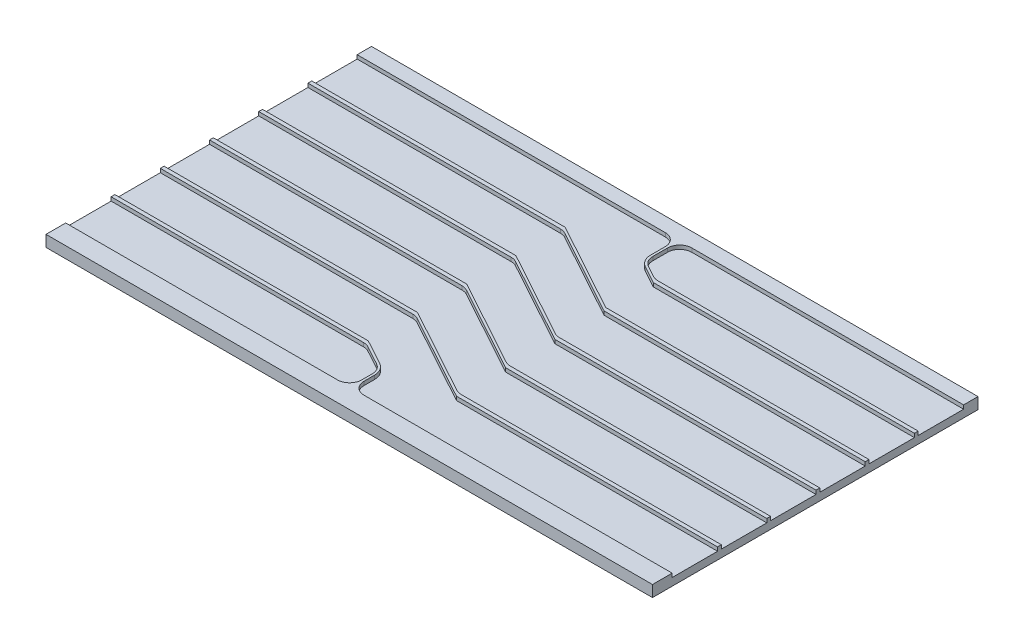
ISO-10303-21;
HEADER;
FILE_DESCRIPTION(('STEP AP214'),'2;1');
FILE_NAME('part.step','',(''),(''),'','','');
FILE_SCHEMA(('AUTOMOTIVE_DESIGN { 1 0 10303 214 1 1 1 1 }'));
ENDSEC;
DATA;
#1=APPLICATION_CONTEXT('core data for automotive mechanical design processes');
#2=APPLICATION_PROTOCOL_DEFINITION('international standard','automotive_design',2000,#1);
#3=PRODUCT_CONTEXT('',#1,'mechanical');
#4=PRODUCT('Part','Part','',(#3));
#5=PRODUCT_RELATED_PRODUCT_CATEGORY('part','',(#4));
#6=PRODUCT_DEFINITION_FORMATION('','',#4);
#7=PRODUCT_DEFINITION_CONTEXT('part definition',#1,'design');
#8=PRODUCT_DEFINITION('design','',#6,#7);
#9=PRODUCT_DEFINITION_SHAPE('','',#8);
#10=(LENGTH_UNIT() NAMED_UNIT(*) SI_UNIT(.MILLI.,.METRE.));
#11=(NAMED_UNIT(*) PLANE_ANGLE_UNIT() SI_UNIT($,.RADIAN.));
#12=(NAMED_UNIT(*) SI_UNIT($,.STERADIAN.) SOLID_ANGLE_UNIT());
#13=UNCERTAINTY_MEASURE_WITH_UNIT(LENGTH_MEASURE(1.E-05),#10,'distance_accuracy_value','');
#14=(GEOMETRIC_REPRESENTATION_CONTEXT(3) GLOBAL_UNCERTAINTY_ASSIGNED_CONTEXT((#13)) GLOBAL_UNIT_ASSIGNED_CONTEXT((#10,
#11,#12)) REPRESENTATION_CONTEXT('',''));
#15=CARTESIAN_POINT('',(0.,0.,0.));
#16=DIRECTION('',(0.,0.,1.));
#17=DIRECTION('',(1.,0.,0.));
#18=AXIS2_PLACEMENT_3D('',#15,#16,#17);
#19=CARTESIAN_POINT('',(400.554306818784,134.993009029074,215.));
#20=DIRECTION('',(-1.74532925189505E-05,-0.999999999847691,0.));
#21=DIRECTION('',(0.999999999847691,-1.74532925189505E-05,0.));
#22=AXIS2_PLACEMENT_3D('',#19,#20,#21);
#23=PLANE('',#22);
#24=DIRECTION('',(0.,0.,1.));
#25=VECTOR('',#24,1.);
#26=CARTESIAN_POINT('',(801.106257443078,134.98601807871,215.));
#27=LINE('',#26,#25);
#28=CARTESIAN_POINT('',(801.106257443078,134.98601807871,144.));
#29=VERTEX_POINT('',#28);
#30=CARTESIAN_POINT('',(801.106257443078,134.98601807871,149.));
#31=VERTEX_POINT('',#30);
#32=EDGE_CURVE('E1093',#29,#31,#27,.T.);
#33=ORIENTED_EDGE('',*,*,#32,.F.);
#34=DIRECTION('',(0.999999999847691,-1.74532925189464E-05,0.));
#35=VECTOR('',#34,1.);
#36=CARTESIAN_POINT('',(801.106257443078,134.98601807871,144.));
#37=LINE('',#36,#35);
#38=CARTESIAN_POINT('',(453.317471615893,134.992088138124,144.));
#39=VERTEX_POINT('',#38);
#40=EDGE_CURVE('E522',#39,#29,#37,.T.);
#41=ORIENTED_EDGE('',*,*,#40,.F.);
#42=DIRECTION('',(0.876896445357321,-1.53047301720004E-05,0.480679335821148));
#43=VECTOR('',#42,1.);
#44=CARTESIAN_POINT('',(453.317471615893,134.992088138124,144.));
#45=LINE('',#44,#43);
#46=CARTESIAN_POINT('',(334.73890020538,134.994157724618,79.0000000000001));
#47=VERTEX_POINT('',#46);
#48=EDGE_CURVE('E574',#47,#39,#45,.T.);
#49=ORIENTED_EDGE('',*,*,#48,.F.);
#50=DIRECTION('',(0.999999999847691,-1.7453292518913E-05,0.));
#51=VECTOR('',#50,1.);
#52=CARTESIAN_POINT('',(334.73890020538,134.994157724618,79.0000000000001));
#53=LINE('',#52,#51);
#54=CARTESIAN_POINT('',(0.00235619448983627,134.999999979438,79.0000000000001));
#55=VERTEX_POINT('',#54);
#56=EDGE_CURVE('E571',#55,#47,#53,.T.);
#57=ORIENTED_EDGE('',*,*,#56,.F.);
#58=DIRECTION('',(0.,0.,1.));
#59=VECTOR('',#58,1.);
#60=CARTESIAN_POINT('',(0.00235619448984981,134.999999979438,215.));
#61=LINE('',#60,#59);
#62=CARTESIAN_POINT('',(0.00235619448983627,134.999999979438,84.0000000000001));
#63=VERTEX_POINT('',#62);
#64=EDGE_CURVE('E1159',#63,#55,#61,.F.);
#65=ORIENTED_EDGE('',*,*,#64,.F.);
#66=DIRECTION('',(-0.999999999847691,1.74532925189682E-05,0.));
#67=VECTOR('',#66,1.);
#68=CARTESIAN_POINT('',(333.521509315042,134.994178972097,84.0000000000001));
#69=LINE('',#68,#67);
#70=CARTESIAN_POINT('',(333.521509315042,134.994178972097,84.0000000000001));
#71=VERTEX_POINT('',#70);
#72=EDGE_CURVE('E642',#71,#63,#69,.T.);
#73=ORIENTED_EDGE('',*,*,#72,.F.);
#74=CARTESIAN_POINT('',(333.521509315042,134.994178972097,100.));
#75=DIRECTION('',(1.74532925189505E-05,0.999999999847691,0.));
#76=DIRECTION('',(0.999999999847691,-1.74532925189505E-05,0.));
#77=AXIS2_PLACEMENT_3D('',#74,#75,#76);
#78=CIRCLE('',#77,16.);
#79=CARTESIAN_POINT('',(341.212378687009,134.994044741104,85.969656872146));
#80=VERTEX_POINT('',#79);
#81=EDGE_CURVE('E639',#80,#71,#78,.T.);
#82=ORIENTED_EDGE('',*,*,#81,.F.);
#83=DIRECTION('',(-0.876896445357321,1.53047301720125E-05,-0.480679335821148));
#84=VECTOR('',#83,1.);
#85=CARTESIAN_POINT('',(456.197733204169,134.992037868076,149.));
#86=LINE('',#85,#84);
#87=CARTESIAN_POINT('',(456.197733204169,134.992037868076,149.));
#88=VERTEX_POINT('',#87);
#89=EDGE_CURVE('E636',#88,#80,#86,.T.);
#90=ORIENTED_EDGE('',*,*,#89,.F.);
#91=DIRECTION('',(-0.999999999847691,1.74532925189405E-05,0.));
#92=VECTOR('',#91,1.);
#93=CARTESIAN_POINT('',(801.106257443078,134.98601807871,149.));
#94=LINE('',#93,#92);
#95=EDGE_CURVE('E581',#31,#88,#94,.T.);
#96=ORIENTED_EDGE('',*,*,#95,.F.);
#97=EDGE_LOOP('',(#33,#41,#49,#57,#65,#73,#82,#90,#96));
#98=FACE_BOUND('',#97,.T.);
#99=ADVANCED_FACE('F33',(#98),#23,.F.);
#100=CARTESIAN_POINT('',(801.106257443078,134.98601807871,209.));
#101=VERTEX_POINT('',#100);
#102=CARTESIAN_POINT('',(801.106257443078,134.98601807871,214.));
#103=VERTEX_POINT('',#102);
#104=EDGE_CURVE('E1094',#101,#103,#27,.T.);
#105=ORIENTED_EDGE('',*,*,#104,.F.);
#106=DIRECTION('',(0.999999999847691,-1.74532925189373E-05,0.));
#107=VECTOR('',#106,1.);
#108=CARTESIAN_POINT('',(801.106257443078,134.98601807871,209.));
#109=LINE('',#108,#107);
#110=CARTESIAN_POINT('',(457.411522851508,134.992016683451,209.));
#111=VERTEX_POINT('',#110);
#112=EDGE_CURVE('E606',#111,#101,#109,.T.);
#113=ORIENTED_EDGE('',*,*,#112,.F.);
#114=CARTESIAN_POINT('',(457.411522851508,134.992016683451,193.));
#115=DIRECTION('',(1.74532925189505E-05,0.999999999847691,0.));
#116=DIRECTION('',(-0.999999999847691,1.74532925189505E-05,0.));
#117=AXIS2_PLACEMENT_3D('',#114,#115,#116);
#118=CIRCLE('',#117,16.);
#119=CARTESIAN_POINT('',(449.720653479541,134.992150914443,207.030343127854));
#120=VERTEX_POINT('',#119);
#121=EDGE_CURVE('E650',#120,#111,#118,.T.);
#122=ORIENTED_EDGE('',*,*,#121,.F.);
#123=DIRECTION('',(0.876896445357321,-1.53047301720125E-05,0.480679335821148));
#124=VECTOR('',#123,1.);
#125=CARTESIAN_POINT('',(449.720653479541,134.992150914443,207.030343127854));
#126=LINE('',#125,#124);
#127=CARTESIAN_POINT('',(334.735298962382,134.994157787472,144.));
#128=VERTEX_POINT('',#127);
#129=EDGE_CURVE('E647',#128,#120,#126,.T.);
#130=ORIENTED_EDGE('',*,*,#129,.F.);
#131=DIRECTION('',(0.999999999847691,-1.74532925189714E-05,0.));
#132=VECTOR('',#131,1.);
#133=CARTESIAN_POINT('',(334.735298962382,134.994157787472,144.));
#134=LINE('',#133,#132);
#135=CARTESIAN_POINT('',(0.00235619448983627,134.999999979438,144.));
#136=VERTEX_POINT('',#135);
#137=EDGE_CURVE('E644',#136,#128,#134,.T.);
#138=ORIENTED_EDGE('',*,*,#137,.F.);
#139=CARTESIAN_POINT('',(0.00235619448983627,134.999999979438,149.));
#140=VERTEX_POINT('',#139);
#141=EDGE_CURVE('E1155',#140,#136,#61,.F.);
#142=ORIENTED_EDGE('',*,*,#141,.F.);
#143=DIRECTION('',(-0.999999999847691,1.74532925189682E-05,0.));
#144=VECTOR('',#143,1.);
#145=CARTESIAN_POINT('',(333.521509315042,134.994178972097,149.));
#146=LINE('',#145,#144);
#147=CARTESIAN_POINT('',(333.521509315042,134.994178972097,149.));
#148=VERTEX_POINT('',#147);
#149=EDGE_CURVE('E717',#148,#140,#146,.T.);
#150=ORIENTED_EDGE('',*,*,#149,.F.);
#151=CARTESIAN_POINT('',(333.521509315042,134.994178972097,165.));
#152=DIRECTION('',(1.74532925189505E-05,0.999999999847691,0.));
#153=DIRECTION('',(0.999999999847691,-1.74532925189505E-05,0.));
#154=AXIS2_PLACEMENT_3D('',#151,#152,#153);
#155=CIRCLE('',#154,16.);
#156=CARTESIAN_POINT('',(341.212378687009,134.994044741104,150.969656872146));
#157=VERTEX_POINT('',#156);
#158=EDGE_CURVE('E714',#157,#148,#155,.T.);
#159=ORIENTED_EDGE('',*,*,#158,.F.);
#160=DIRECTION('',(-0.876896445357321,1.53047301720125E-05,-0.480679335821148));
#161=VECTOR('',#160,1.);
#162=CARTESIAN_POINT('',(456.197733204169,134.992037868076,214.));
#163=LINE('',#162,#161);
#164=CARTESIAN_POINT('',(456.197733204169,134.992037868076,214.));
#165=VERTEX_POINT('',#164);
#166=EDGE_CURVE('E711',#165,#157,#163,.T.);
#167=ORIENTED_EDGE('',*,*,#166,.F.);
#168=DIRECTION('',(-0.999999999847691,1.74532925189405E-05,0.));
#169=VECTOR('',#168,1.);
#170=CARTESIAN_POINT('',(801.106257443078,134.98601807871,214.));
#171=LINE('',#170,#169);
#172=EDGE_CURVE('E657',#103,#165,#171,.T.);
#173=ORIENTED_EDGE('',*,*,#172,.F.);
#174=EDGE_LOOP('',(#105,#113,#122,#130,#138,#142,#150,#159,#167,#173));
#175=FACE_BOUND('',#174,.T.);
#176=ADVANCED_FACE('F1216',(#175),#23,.F.);
#177=CARTESIAN_POINT('',(801.106257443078,134.98601807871,274.));
#178=VERTEX_POINT('',#177);
#179=CARTESIAN_POINT('',(801.106257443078,134.98601807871,279.));
#180=VERTEX_POINT('',#179);
#181=EDGE_CURVE('E1097',#178,#180,#27,.T.);
#182=ORIENTED_EDGE('',*,*,#181,.F.);
#183=DIRECTION('',(0.999999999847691,-1.74532925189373E-05,0.));
#184=VECTOR('',#183,1.);
#185=CARTESIAN_POINT('',(801.106257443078,134.98601807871,274.));
#186=LINE('',#185,#184);
#187=CARTESIAN_POINT('',(457.411522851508,134.992016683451,274.));
#188=VERTEX_POINT('',#187);
#189=EDGE_CURVE('E681',#188,#178,#186,.T.);
#190=ORIENTED_EDGE('',*,*,#189,.F.);
#191=CARTESIAN_POINT('',(457.411522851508,134.992016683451,258.));
#192=DIRECTION('',(1.74532925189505E-05,0.999999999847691,0.));
#193=DIRECTION('',(-0.999999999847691,1.74532925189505E-05,0.));
#194=AXIS2_PLACEMENT_3D('',#191,#192,#193);
#195=CIRCLE('',#194,16.);
#196=CARTESIAN_POINT('',(449.720653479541,134.992150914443,272.030343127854));
#197=VERTEX_POINT('',#196);
#198=EDGE_CURVE('E725',#197,#188,#195,.T.);
#199=ORIENTED_EDGE('',*,*,#198,.F.);
#200=DIRECTION('',(0.876896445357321,-1.53047301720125E-05,0.480679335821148));
#201=VECTOR('',#200,1.);
#202=CARTESIAN_POINT('',(449.720653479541,134.992150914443,272.030343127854));
#203=LINE('',#202,#201);
#204=CARTESIAN_POINT('',(334.735298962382,134.994157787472,209.));
#205=VERTEX_POINT('',#204);
#206=EDGE_CURVE('E722',#205,#197,#203,.T.);
#207=ORIENTED_EDGE('',*,*,#206,.F.);
#208=DIRECTION('',(0.999999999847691,-1.74532925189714E-05,0.));
#209=VECTOR('',#208,1.);
#210=CARTESIAN_POINT('',(334.735298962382,134.994157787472,209.));
#211=LINE('',#210,#209);
#212=CARTESIAN_POINT('',(0.00235619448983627,134.999999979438,209.));
#213=VERTEX_POINT('',#212);
#214=EDGE_CURVE('E719',#213,#205,#211,.T.);
#215=ORIENTED_EDGE('',*,*,#214,.F.);
#216=CARTESIAN_POINT('',(0.00235619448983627,134.999999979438,214.));
#217=VERTEX_POINT('',#216);
#218=EDGE_CURVE('E1151',#217,#213,#61,.F.);
#219=ORIENTED_EDGE('',*,*,#218,.F.);
#220=DIRECTION('',(-0.999999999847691,1.74532925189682E-05,0.));
#221=VECTOR('',#220,1.);
#222=CARTESIAN_POINT('',(333.521509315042,134.994178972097,214.));
#223=LINE('',#222,#221);
#224=CARTESIAN_POINT('',(333.521509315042,134.994178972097,214.));
#225=VERTEX_POINT('',#224);
#226=EDGE_CURVE('E792',#225,#217,#223,.T.);
#227=ORIENTED_EDGE('',*,*,#226,.F.);
#228=CARTESIAN_POINT('',(333.521509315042,134.994178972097,230.));
#229=DIRECTION('',(1.74532925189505E-05,0.999999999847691,0.));
#230=DIRECTION('',(0.999999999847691,-1.74532925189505E-05,0.));
#231=AXIS2_PLACEMENT_3D('',#228,#229,#230);
#232=CIRCLE('',#231,16.);
#233=CARTESIAN_POINT('',(341.212378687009,134.994044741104,215.969656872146));
#234=VERTEX_POINT('',#233);
#235=EDGE_CURVE('E789',#234,#225,#232,.T.);
#236=ORIENTED_EDGE('',*,*,#235,.F.);
#237=DIRECTION('',(-0.876896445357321,1.53047301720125E-05,-0.480679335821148));
#238=VECTOR('',#237,1.);
#239=CARTESIAN_POINT('',(456.197733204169,134.992037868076,279.));
#240=LINE('',#239,#238);
#241=CARTESIAN_POINT('',(456.197733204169,134.992037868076,279.));
#242=VERTEX_POINT('',#241);
#243=EDGE_CURVE('E786',#242,#234,#240,.T.);
#244=ORIENTED_EDGE('',*,*,#243,.F.);
#245=DIRECTION('',(-0.999999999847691,1.74532925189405E-05,0.));
#246=VECTOR('',#245,1.);
#247=CARTESIAN_POINT('',(801.106257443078,134.98601807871,279.));
#248=LINE('',#247,#246);
#249=EDGE_CURVE('E732',#180,#242,#248,.T.);
#250=ORIENTED_EDGE('',*,*,#249,.F.);
#251=EDGE_LOOP('',(#182,#190,#199,#207,#215,#219,#227,#236,#244,#250));
#252=FACE_BOUND('',#251,.T.);
#253=ADVANCED_FACE('F1234',(#252),#23,.F.);
#254=CARTESIAN_POINT('',(801.106257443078,134.98601807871,339.));
#255=VERTEX_POINT('',#254);
#256=CARTESIAN_POINT('',(801.106257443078,134.98601807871,344.));
#257=VERTEX_POINT('',#256);
#258=EDGE_CURVE('E1100',#255,#257,#27,.T.);
#259=ORIENTED_EDGE('',*,*,#258,.F.);
#260=DIRECTION('',(0.999999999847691,-1.74532925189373E-05,0.));
#261=VECTOR('',#260,1.);
#262=CARTESIAN_POINT('',(801.106257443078,134.98601807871,339.));
#263=LINE('',#262,#261);
#264=CARTESIAN_POINT('',(457.411522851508,134.992016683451,339.));
#265=VERTEX_POINT('',#264);
#266=EDGE_CURVE('E756',#265,#255,#263,.T.);
#267=ORIENTED_EDGE('',*,*,#266,.F.);
#268=CARTESIAN_POINT('',(457.411522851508,134.992016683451,323.));
#269=DIRECTION('',(1.74532925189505E-05,0.999999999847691,0.));
#270=DIRECTION('',(-0.999999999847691,1.74532925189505E-05,0.));
#271=AXIS2_PLACEMENT_3D('',#268,#269,#270);
#272=CIRCLE('',#271,16.);
#273=CARTESIAN_POINT('',(449.720653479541,134.992150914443,337.030343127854));
#274=VERTEX_POINT('',#273);
#275=EDGE_CURVE('E800',#274,#265,#272,.T.);
#276=ORIENTED_EDGE('',*,*,#275,.F.);
#277=DIRECTION('',(0.876896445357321,-1.53047301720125E-05,0.480679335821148));
#278=VECTOR('',#277,1.);
#279=CARTESIAN_POINT('',(449.720653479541,134.992150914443,337.030343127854));
#280=LINE('',#279,#278);
#281=CARTESIAN_POINT('',(334.735298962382,134.994157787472,274.));
#282=VERTEX_POINT('',#281);
#283=EDGE_CURVE('E797',#282,#274,#280,.T.);
#284=ORIENTED_EDGE('',*,*,#283,.F.);
#285=DIRECTION('',(0.999999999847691,-1.74532925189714E-05,0.));
#286=VECTOR('',#285,1.);
#287=CARTESIAN_POINT('',(334.735298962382,134.994157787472,274.));
#288=LINE('',#287,#286);
#289=CARTESIAN_POINT('',(0.00235619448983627,134.999999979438,274.));
#290=VERTEX_POINT('',#289);
#291=EDGE_CURVE('E794',#290,#282,#288,.T.);
#292=ORIENTED_EDGE('',*,*,#291,.F.);
#293=CARTESIAN_POINT('',(0.00235619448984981,134.999999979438,279.));
#294=VERTEX_POINT('',#293);
#295=EDGE_CURVE('E1149',#294,#290,#61,.F.);
#296=ORIENTED_EDGE('',*,*,#295,.F.);
#297=DIRECTION('',(-0.999999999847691,1.74532925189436E-05,0.));
#298=VECTOR('',#297,1.);
#299=CARTESIAN_POINT('',(0.00235619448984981,134.999999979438,279.));
#300=LINE('',#299,#298);
#301=CARTESIAN_POINT('',(333.517908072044,134.994179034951,279.));
#302=VERTEX_POINT('',#301);
#303=EDGE_CURVE('E873',#302,#294,#300,.T.);
#304=ORIENTED_EDGE('',*,*,#303,.F.);
#305=CARTESIAN_POINT('',(333.517908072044,134.994179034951,295.));
#306=DIRECTION('',(1.74532925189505E-05,0.999999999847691,0.));
#307=DIRECTION('',(0.999999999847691,-1.74532925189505E-05,0.));
#308=AXIS2_PLACEMENT_3D('',#305,#306,#307);
#309=CIRCLE('',#308,16.);
#310=CARTESIAN_POINT('',(341.208777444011,134.994044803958,280.969656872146));
#311=VERTEX_POINT('',#310);
#312=EDGE_CURVE('E870',#311,#302,#309,.T.);
#313=ORIENTED_EDGE('',*,*,#312,.F.);
#314=DIRECTION('',(-0.876896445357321,1.53047301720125E-05,-0.480679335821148));
#315=VECTOR('',#314,1.);
#316=CARTESIAN_POINT('',(341.208777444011,134.994044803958,280.969656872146));
#317=LINE('',#316,#315);
#318=CARTESIAN_POINT('',(456.19413196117,134.99203793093,344.));
#319=VERTEX_POINT('',#318);
#320=EDGE_CURVE('E867',#319,#311,#317,.T.);
#321=ORIENTED_EDGE('',*,*,#320,.F.);
#322=DIRECTION('',(-0.999999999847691,1.74532925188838E-05,0.));
#323=VECTOR('',#322,1.);
#324=CARTESIAN_POINT('',(456.19413196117,134.99203793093,344.));
#325=LINE('',#324,#323);
#326=EDGE_CURVE('E807',#257,#319,#325,.T.);
#327=ORIENTED_EDGE('',*,*,#326,.F.);
#328=EDGE_LOOP('',(#259,#267,#276,#284,#292,#296,#304,#313,#321,#327));
#329=FACE_BOUND('',#328,.T.);
#330=ADVANCED_FACE('F1113',(#329),#23,.F.);
#331=CARTESIAN_POINT('',(801.106257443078,134.98601807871,404.));
#332=VERTEX_POINT('',#331);
#333=CARTESIAN_POINT('',(801.106257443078,134.98601807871,430.));
#334=VERTEX_POINT('',#333);
#335=EDGE_CURVE('E997',#332,#334,#27,.T.);
#336=ORIENTED_EDGE('',*,*,#335,.F.);
#337=DIRECTION('',(0.999999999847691,-1.74532925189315E-05,0.));
#338=VECTOR('',#337,1.);
#339=CARTESIAN_POINT('',(801.106257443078,134.98601807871,404.));
#340=LINE('',#339,#338);
#341=CARTESIAN_POINT('',(394.054306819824,134.993122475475,404.));
#342=VERTEX_POINT('',#341);
#343=EDGE_CURVE('E831',#342,#332,#340,.T.);
#344=ORIENTED_EDGE('',*,*,#343,.F.);
#345=CARTESIAN_POINT('',(394.054306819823,134.993122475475,388.));
#346=DIRECTION('',(1.74532925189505E-05,0.999999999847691,0.));
#347=DIRECTION('',(-0.999999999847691,1.74532925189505E-05,0.));
#348=AXIS2_PLACEMENT_3D('',#345,#346,#347);
#349=CIRCLE('',#348,16.);
#350=CARTESIAN_POINT('',(378.05430682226,134.993401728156,388.));
#351=VERTEX_POINT('',#350);
#352=EDGE_CURVE('E887',#351,#342,#349,.T.);
#353=ORIENTED_EDGE('',*,*,#352,.F.);
#354=DIRECTION('',(0.,0.,1.));
#355=VECTOR('',#354,1.);
#356=CARTESIAN_POINT('',(378.05430682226,134.993401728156,388.));
#357=LINE('',#356,#355);
#358=CARTESIAN_POINT('',(378.05430682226,134.993401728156,373.999999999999));
#359=VERTEX_POINT('',#358);
#360=EDGE_CURVE('E884',#359,#351,#357,.T.);
#361=ORIENTED_EDGE('',*,*,#360,.F.);
#362=CARTESIAN_POINT('',(359.054306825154,134.993733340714,373.999999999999));
#363=DIRECTION('',(-1.74532925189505E-05,-0.999999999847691,0.));
#364=DIRECTION('',(-0.999999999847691,1.74532925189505E-05,0.));
#365=AXIS2_PLACEMENT_3D('',#362,#363,#364);
#366=CIRCLE('',#365,19.);
#367=CARTESIAN_POINT('',(368.187214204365,134.993573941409,357.338967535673));
#368=VERTEX_POINT('',#367);
#369=EDGE_CURVE('E881',#368,#359,#366,.T.);
#370=ORIENTED_EDGE('',*,*,#369,.F.);
#371=DIRECTION('',(0.876896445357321,-1.53047301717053E-05,0.480679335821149));
#372=VECTOR('',#371,1.);
#373=CARTESIAN_POINT('',(368.187214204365,134.993573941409,357.338967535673));
#374=LINE('',#373,#372);
#375=CARTESIAN_POINT('',(334.731697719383,134.994157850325,339.));
#376=VERTEX_POINT('',#375);
#377=EDGE_CURVE('E878',#376,#368,#374,.T.);
#378=ORIENTED_EDGE('',*,*,#377,.F.);
#379=DIRECTION('',(0.999999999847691,-1.74532925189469E-05,0.));
#380=VECTOR('',#379,1.);
#381=CARTESIAN_POINT('',(334.731697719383,134.994157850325,339.));
#382=LINE('',#381,#380);
#383=CARTESIAN_POINT('',(0.00235619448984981,134.999999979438,339.));
#384=VERTEX_POINT('',#383);
#385=EDGE_CURVE('E875',#384,#376,#382,.T.);
#386=ORIENTED_EDGE('',*,*,#385,.F.);
#387=CARTESIAN_POINT('',(0.00235619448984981,134.999999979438,344.));
#388=VERTEX_POINT('',#387);
#389=EDGE_CURVE('E1002',#388,#384,#61,.F.);
#390=ORIENTED_EDGE('',*,*,#389,.F.);
#391=DIRECTION('',(-0.999999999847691,1.7453292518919E-05,0.));
#392=VECTOR('',#391,1.);
#393=CARTESIAN_POINT('',(333.514306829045,134.994179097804,344.));
#394=LINE('',#393,#392);
#395=CARTESIAN_POINT('',(333.514306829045,134.994179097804,344.));
#396=VERTEX_POINT('',#395);
#397=EDGE_CURVE('E922',#396,#388,#394,.T.);
#398=ORIENTED_EDGE('',*,*,#397,.F.);
#399=CARTESIAN_POINT('',(333.514306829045,134.994179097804,360.));
#400=DIRECTION('',(1.74532925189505E-05,0.999999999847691,0.));
#401=DIRECTION('',(0.999999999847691,-1.74532925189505E-05,0.));
#402=AXIS2_PLACEMENT_3D('',#399,#400,#401);
#403=CIRCLE('',#402,16.);
#404=CARTESIAN_POINT('',(341.205176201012,134.994044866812,345.969656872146));
#405=VERTEX_POINT('',#404);
#406=EDGE_CURVE('E958',#405,#396,#403,.T.);
#407=ORIENTED_EDGE('',*,*,#406,.F.);
#408=DIRECTION('',(-0.876896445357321,1.53047301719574E-05,-0.480679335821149));
#409=VECTOR('',#408,1.);
#410=CARTESIAN_POINT('',(366.745176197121,134.993599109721,359.969656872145));
#411=LINE('',#410,#409);
#412=CARTESIAN_POINT('',(366.745176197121,134.993599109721,359.969656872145));
#413=VERTEX_POINT('',#412);
#414=EDGE_CURVE('E955',#413,#405,#411,.T.);
#415=ORIENTED_EDGE('',*,*,#414,.F.);
#416=CARTESIAN_POINT('',(359.054306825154,134.993733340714,373.999999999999));
#417=DIRECTION('',(1.74532925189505E-05,0.999999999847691,0.));
#418=DIRECTION('',(0.999999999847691,-1.74532925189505E-05,0.));
#419=AXIS2_PLACEMENT_3D('',#416,#417,#418);
#420=CIRCLE('',#419,16.);
#421=CARTESIAN_POINT('',(375.054306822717,134.993454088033,373.999999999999));
#422=VERTEX_POINT('',#421);
#423=EDGE_CURVE('E952',#422,#413,#420,.T.);
#424=ORIENTED_EDGE('',*,*,#423,.F.);
#425=DIRECTION('',(0.,0.,-1.));
#426=VECTOR('',#425,1.);
#427=CARTESIAN_POINT('',(375.054306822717,134.993454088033,388.));
#428=LINE('',#427,#426);
#429=CARTESIAN_POINT('',(375.054306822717,134.993454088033,388.));
#430=VERTEX_POINT('',#429);
#431=EDGE_CURVE('E949',#430,#422,#428,.T.);
#432=ORIENTED_EDGE('',*,*,#431,.F.);
#433=CARTESIAN_POINT('',(359.054306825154,134.993733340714,388.));
#434=DIRECTION('',(1.74532925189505E-05,0.999999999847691,0.));
#435=DIRECTION('',(-0.999999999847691,1.74532925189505E-05,0.));
#436=AXIS2_PLACEMENT_3D('',#433,#434,#435);
#437=CIRCLE('',#436,16.);
#438=CARTESIAN_POINT('',(359.054306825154,134.993733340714,404.));
#439=VERTEX_POINT('',#438);
#440=EDGE_CURVE('E946',#439,#430,#437,.T.);
#441=ORIENTED_EDGE('',*,*,#440,.F.);
#442=DIRECTION('',(0.999999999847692,-1.74532925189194E-05,0.));
#443=VECTOR('',#442,1.);
#444=CARTESIAN_POINT('',(0.00235619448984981,134.999999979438,404.));
#445=LINE('',#444,#443);
#446=CARTESIAN_POINT('',(0.00235619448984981,134.999999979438,404.));
#447=VERTEX_POINT('',#446);
#448=EDGE_CURVE('E894',#447,#439,#445,.T.);
#449=ORIENTED_EDGE('',*,*,#448,.F.);
#450=CARTESIAN_POINT('',(0.00235619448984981,134.999999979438,430.));
#451=VERTEX_POINT('',#450);
#452=EDGE_CURVE('E983',#451,#447,#61,.F.);
#453=ORIENTED_EDGE('',*,*,#452,.F.);
#454=DIRECTION('',(0.999999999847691,-1.74532925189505E-05,0.));
#455=VECTOR('',#454,1.);
#456=CARTESIAN_POINT('',(400.554306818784,134.993009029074,430.));
#457=LINE('',#456,#455);
#458=EDGE_CURVE('E992',#334,#451,#457,.F.);
#459=ORIENTED_EDGE('',*,*,#458,.F.);
#460=EDGE_LOOP('',(#336,#344,#353,#361,#370,#378,#386,#390,#398,#407,#415,#424,#432,#441,#449,
#453,#459));
#461=FACE_BOUND('',#460,.T.);
#462=ADVANCED_FACE('F1022',(#461),#23,.F.);
#463=CARTESIAN_POINT('',(801.10599564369,119.986018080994,0.));
#464=DIRECTION('',(0.,0.,-1.));
#465=DIRECTION('',(0.999999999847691,-1.74532925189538E-05,0.));
#466=AXIS2_PLACEMENT_3D('',#463,#464,#465);
#467=PLANE('',#466);
#468=DIRECTION('',(-1.74532925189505E-05,-0.999999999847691,0.));
#469=VECTOR('',#468,1.);
#470=CARTESIAN_POINT('',(0.0020943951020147,119.999999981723,0.));
#471=LINE('',#470,#469);
#472=CARTESIAN_POINT('',(0.00235619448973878,134.999999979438,0.));
#473=VERTEX_POINT('',#472);
#474=CARTESIAN_POINT('',(0.0020943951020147,119.999999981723,0.));
#475=VERTEX_POINT('',#474);
#476=EDGE_CURVE('E11',#473,#475,#471,.T.);
#477=ORIENTED_EDGE('',*,*,#476,.F.);
#478=DIRECTION('',(0.999999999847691,-1.74532925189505E-05,0.));
#479=VECTOR('',#478,1.);
#480=CARTESIAN_POINT('',(400.554306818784,134.993009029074,0.));
#481=LINE('',#480,#479);
#482=CARTESIAN_POINT('',(801.106257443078,134.98601807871,0.));
#483=VERTEX_POINT('',#482);
#484=EDGE_CURVE('E965',#473,#483,#481,.T.);
#485=ORIENTED_EDGE('',*,*,#484,.T.);
#486=DIRECTION('',(-1.74532925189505E-05,-0.999999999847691,0.));
#487=VECTOR('',#486,1.);
#488=CARTESIAN_POINT('',(801.10599564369,119.986018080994,0.));
#489=LINE('',#488,#487);
#490=CARTESIAN_POINT('',(801.10599564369,119.986018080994,0.));
#491=VERTEX_POINT('',#490);
#492=EDGE_CURVE('E42',#483,#491,#489,.T.);
#493=ORIENTED_EDGE('',*,*,#492,.T.);
#494=DIRECTION('',(0.999999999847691,-1.74532925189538E-05,0.));
#495=VECTOR('',#494,1.);
#496=CARTESIAN_POINT('',(801.10599564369,119.986018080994,0.));
#497=LINE('',#496,#495);
#498=EDGE_CURVE('E979',#475,#491,#497,.T.);
#499=ORIENTED_EDGE('',*,*,#498,.F.);
#500=EDGE_LOOP('',(#477,#485,#493,#499));
#501=FACE_BOUND('',#500,.T.);
#502=ADVANCED_FACE('F1008',(#501),#467,.T.);
#503=CARTESIAN_POINT('',(801.10599564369,119.986018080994,430.));
#504=DIRECTION('',(0.999999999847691,-1.74532925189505E-05,0.));
#505=DIRECTION('',(0.,0.,1.));
#506=AXIS2_PLACEMENT_3D('',#503,#504,#505);
#507=PLANE('',#506);
#508=DIRECTION('',(1.74532925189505E-05,0.999999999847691,0.));
#509=VECTOR('',#508,1.);
#510=CARTESIAN_POINT('',(801.106170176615,129.986018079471,79.));
#511=LINE('',#510,#509);
#512=CARTESIAN_POINT('',(801.106170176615,129.986018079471,79.));
#513=VERTEX_POINT('',#512);
#514=CARTESIAN_POINT('',(801.106257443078,134.98601807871,79.));
#515=VERTEX_POINT('',#514);
#516=EDGE_CURVE('E557',#513,#515,#511,.T.);
#517=ORIENTED_EDGE('',*,*,#516,.T.);
#518=CARTESIAN_POINT('',(801.106257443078,134.98601807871,84.));
#519=VERTEX_POINT('',#518);
#520=EDGE_CURVE('E57',#515,#519,#27,.T.);
#521=ORIENTED_EDGE('',*,*,#520,.T.);
#522=DIRECTION('',(1.74532925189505E-05,0.999999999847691,0.));
#523=VECTOR('',#522,1.);
#524=CARTESIAN_POINT('',(801.106170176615,129.986018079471,84.));
#525=LINE('',#524,#523);
#526=CARTESIAN_POINT('',(801.106170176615,129.986018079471,84.));
#527=VERTEX_POINT('',#526);
#528=EDGE_CURVE('E552',#527,#519,#525,.T.);
#529=ORIENTED_EDGE('',*,*,#528,.F.);
#530=DIRECTION('',(0.,0.,-1.));
#531=VECTOR('',#530,1.);
#532=CARTESIAN_POINT('',(801.106170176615,129.986018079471,84.));
#533=LINE('',#532,#531);
#534=CARTESIAN_POINT('',(801.106170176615,129.986018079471,144.));
#535=VERTEX_POINT('',#534);
#536=EDGE_CURVE('E518',#535,#527,#533,.T.);
#537=ORIENTED_EDGE('',*,*,#536,.F.);
#538=DIRECTION('',(1.74532925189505E-05,0.999999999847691,0.));
#539=VECTOR('',#538,1.);
#540=CARTESIAN_POINT('',(801.106170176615,129.986018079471,144.));
#541=LINE('',#540,#539);
#542=EDGE_CURVE('E578',#535,#29,#541,.T.);
#543=ORIENTED_EDGE('',*,*,#542,.T.);
#544=ORIENTED_EDGE('',*,*,#32,.T.);
#545=DIRECTION('',(1.74532925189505E-05,0.999999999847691,0.));
#546=VECTOR('',#545,1.);
#547=CARTESIAN_POINT('',(801.106170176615,129.986018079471,149.));
#548=LINE('',#547,#546);
#549=CARTESIAN_POINT('',(801.106170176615,129.986018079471,149.));
#550=VERTEX_POINT('',#549);
#551=EDGE_CURVE('E633',#550,#31,#548,.T.);
#552=ORIENTED_EDGE('',*,*,#551,.F.);
#553=DIRECTION('',(0.,0.,-1.));
#554=VECTOR('',#553,1.);
#555=CARTESIAN_POINT('',(801.106170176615,129.986018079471,209.));
#556=LINE('',#555,#554);
#557=CARTESIAN_POINT('',(801.106170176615,129.986018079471,209.));
#558=VERTEX_POINT('',#557);
#559=EDGE_CURVE('E602',#558,#550,#556,.T.);
#560=ORIENTED_EDGE('',*,*,#559,.F.);
#561=DIRECTION('',(1.74532925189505E-05,0.999999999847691,0.));
#562=VECTOR('',#561,1.);
#563=CARTESIAN_POINT('',(801.106170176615,129.986018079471,209.));
#564=LINE('',#563,#562);
#565=EDGE_CURVE('E654',#558,#101,#564,.T.);
#566=ORIENTED_EDGE('',*,*,#565,.T.);
#567=ORIENTED_EDGE('',*,*,#104,.T.);
#568=DIRECTION('',(1.74532925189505E-05,0.999999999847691,0.));
#569=VECTOR('',#568,1.);
#570=CARTESIAN_POINT('',(801.106170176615,129.986018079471,214.));
#571=LINE('',#570,#569);
#572=CARTESIAN_POINT('',(801.106170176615,129.986018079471,214.));
#573=VERTEX_POINT('',#572);
#574=EDGE_CURVE('E708',#573,#103,#571,.T.);
#575=ORIENTED_EDGE('',*,*,#574,.F.);
#576=DIRECTION('',(0.,0.,-1.));
#577=VECTOR('',#576,1.);
#578=CARTESIAN_POINT('',(801.106170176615,129.986018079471,274.));
#579=LINE('',#578,#577);
#580=CARTESIAN_POINT('',(801.106170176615,129.986018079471,274.));
#581=VERTEX_POINT('',#580);
#582=EDGE_CURVE('E677',#581,#573,#579,.T.);
#583=ORIENTED_EDGE('',*,*,#582,.F.);
#584=DIRECTION('',(1.74532925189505E-05,0.999999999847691,0.));
#585=VECTOR('',#584,1.);
#586=CARTESIAN_POINT('',(801.106170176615,129.986018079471,274.));
#587=LINE('',#586,#585);
#588=EDGE_CURVE('E729',#581,#178,#587,.T.);
#589=ORIENTED_EDGE('',*,*,#588,.T.);
#590=ORIENTED_EDGE('',*,*,#181,.T.);
#591=DIRECTION('',(1.74532925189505E-05,0.999999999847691,0.));
#592=VECTOR('',#591,1.);
#593=CARTESIAN_POINT('',(801.106170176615,129.986018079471,279.));
#594=LINE('',#593,#592);
#595=CARTESIAN_POINT('',(801.106170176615,129.986018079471,279.));
#596=VERTEX_POINT('',#595);
#597=EDGE_CURVE('E783',#596,#180,#594,.T.);
#598=ORIENTED_EDGE('',*,*,#597,.F.);
#599=DIRECTION('',(0.,0.,-1.));
#600=VECTOR('',#599,1.);
#601=CARTESIAN_POINT('',(801.106170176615,129.986018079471,339.));
#602=LINE('',#601,#600);
#603=CARTESIAN_POINT('',(801.106170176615,129.986018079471,339.));
#604=VERTEX_POINT('',#603);
#605=EDGE_CURVE('E752',#604,#596,#602,.T.);
#606=ORIENTED_EDGE('',*,*,#605,.F.);
#607=DIRECTION('',(1.74532925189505E-05,0.999999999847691,0.));
#608=VECTOR('',#607,1.);
#609=CARTESIAN_POINT('',(801.106170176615,129.986018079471,339.));
#610=LINE('',#609,#608);
#611=EDGE_CURVE('E804',#604,#255,#610,.T.);
#612=ORIENTED_EDGE('',*,*,#611,.T.);
#613=ORIENTED_EDGE('',*,*,#258,.T.);
#614=DIRECTION('',(1.74532925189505E-05,0.999999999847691,0.));
#615=VECTOR('',#614,1.);
#616=CARTESIAN_POINT('',(801.106170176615,129.986018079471,344.));
#617=LINE('',#616,#615);
#618=CARTESIAN_POINT('',(801.106170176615,129.986018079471,344.));
#619=VERTEX_POINT('',#618);
#620=EDGE_CURVE('E864',#619,#257,#617,.T.);
#621=ORIENTED_EDGE('',*,*,#620,.F.);
#622=DIRECTION('',(0.,0.,-1.));
#623=VECTOR('',#622,1.);
#624=CARTESIAN_POINT('',(801.106170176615,129.986018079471,344.));
#625=LINE('',#624,#623);
#626=CARTESIAN_POINT('',(801.106170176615,129.986018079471,404.));
#627=VERTEX_POINT('',#626);
#628=EDGE_CURVE('E827',#627,#619,#625,.T.);
#629=ORIENTED_EDGE('',*,*,#628,.F.);
#630=DIRECTION('',(1.74532925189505E-05,0.999999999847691,0.));
#631=VECTOR('',#630,1.);
#632=CARTESIAN_POINT('',(801.106170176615,129.986018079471,404.));
#633=LINE('',#632,#631);
#634=EDGE_CURVE('E891',#627,#332,#633,.T.);
#635=ORIENTED_EDGE('',*,*,#634,.T.);
#636=ORIENTED_EDGE('',*,*,#335,.T.);
#637=DIRECTION('',(-1.74532925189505E-05,-0.999999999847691,0.));
#638=VECTOR('',#637,1.);
#639=CARTESIAN_POINT('',(801.10599564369,119.986018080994,430.));
#640=LINE('',#639,#638);
#641=CARTESIAN_POINT('',(801.10599564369,119.986018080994,430.));
#642=VERTEX_POINT('',#641);
#643=EDGE_CURVE('E1003',#334,#642,#640,.T.);
#644=ORIENTED_EDGE('',*,*,#643,.T.);
#645=DIRECTION('',(0.,0.,1.));
#646=VECTOR('',#645,1.);
#647=CARTESIAN_POINT('',(801.10599564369,119.986018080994,430.));
#648=LINE('',#647,#646);
#649=EDGE_CURVE('E982',#491,#642,#648,.T.);
#650=ORIENTED_EDGE('',*,*,#649,.F.);
#651=ORIENTED_EDGE('',*,*,#492,.F.);
#652=CARTESIAN_POINT('',(801.106257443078,134.98601807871,19.));
#653=VERTEX_POINT('',#652);
#654=EDGE_CURVE('E510',#483,#653,#27,.T.);
#655=ORIENTED_EDGE('',*,*,#654,.T.);
#656=DIRECTION('',(1.74532925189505E-05,0.999999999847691,0.));
#657=VECTOR('',#656,1.);
#658=CARTESIAN_POINT('',(801.106170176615,129.986018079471,19.));
#659=LINE('',#658,#657);
#660=CARTESIAN_POINT('',(801.106170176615,129.986018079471,19.));
#661=VERTEX_POINT('',#660);
#662=EDGE_CURVE('E49',#661,#653,#659,.T.);
#663=ORIENTED_EDGE('',*,*,#662,.F.);
#664=DIRECTION('',(0.,0.,-1.));
#665=VECTOR('',#664,1.);
#666=CARTESIAN_POINT('',(801.106170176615,129.986018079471,79.));
#667=LINE('',#666,#665);
#668=EDGE_CURVE('E497',#513,#661,#667,.T.);
#669=ORIENTED_EDGE('',*,*,#668,.F.);
#670=EDGE_LOOP('',(#517,#521,#529,#537,#543,#544,#552,#560,#566,#567,#575,#583,#589,#590,#598,
#606,#612,#613,#621,#629,#635,#636,#644,#650,#651,#655,#663,#669));
#671=FACE_BOUND('',#670,.T.);
#672=ADVANCED_FACE('F508',(#671),#507,.T.);
#673=CARTESIAN_POINT('',(801.10599564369,119.986018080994,430.));
#674=DIRECTION('',(0.,0.,1.));
#675=DIRECTION('',(-0.999999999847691,1.74532925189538E-05,0.));
#676=AXIS2_PLACEMENT_3D('',#673,#674,#675);
#677=PLANE('',#676);
#678=ORIENTED_EDGE('',*,*,#643,.F.);
#679=ORIENTED_EDGE('',*,*,#458,.T.);
#680=DIRECTION('',(-1.74532925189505E-05,-0.999999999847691,0.));
#681=VECTOR('',#680,1.);
#682=CARTESIAN_POINT('',(0.00209439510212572,119.999999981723,430.));
#683=LINE('',#682,#681);
#684=CARTESIAN_POINT('',(0.00209439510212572,119.999999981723,430.));
#685=VERTEX_POINT('',#684);
#686=EDGE_CURVE('E37',#451,#685,#683,.T.);
#687=ORIENTED_EDGE('',*,*,#686,.T.);
#688=DIRECTION('',(-0.999999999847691,1.74532925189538E-05,0.));
#689=VECTOR('',#688,1.);
#690=CARTESIAN_POINT('',(801.10599564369,119.986018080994,430.));
#691=LINE('',#690,#689);
#692=EDGE_CURVE('E986',#642,#685,#691,.T.);
#693=ORIENTED_EDGE('',*,*,#692,.F.);
#694=EDGE_LOOP('',(#678,#679,#687,#693));
#695=FACE_BOUND('',#694,.T.);
#696=ADVANCED_FACE('F1019',(#695),#677,.T.);
#697=CARTESIAN_POINT('',(0.00209439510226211,119.999999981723,430.));
#698=DIRECTION('',(-0.999999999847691,1.74532925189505E-05,0.));
#699=DIRECTION('',(0.,0.,-1.));
#700=AXIS2_PLACEMENT_3D('',#697,#698,#699);
#701=PLANE('',#700);
#702=DIRECTION('',(1.74532925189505E-05,0.999999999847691,0.));
#703=VECTOR('',#702,1.);
#704=CARTESIAN_POINT('',(0.00226892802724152,129.9999999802,79.0000000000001));
#705=LINE('',#704,#703);
#706=CARTESIAN_POINT('',(0.00226892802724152,129.9999999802,79.0000000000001));
#707=VERTEX_POINT('',#706);
#708=EDGE_CURVE('E586',#707,#55,#705,.T.);
#709=ORIENTED_EDGE('',*,*,#708,.F.);
#710=DIRECTION('',(0.,0.,1.));
#711=VECTOR('',#710,1.);
#712=CARTESIAN_POINT('',(0.00226892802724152,129.9999999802,79.0000000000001));
#713=LINE('',#712,#711);
#714=CARTESIAN_POINT('',(0.00226892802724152,129.9999999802,19.0000000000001));
#715=VERTEX_POINT('',#714);
#716=EDGE_CURVE('E540',#715,#707,#713,.T.);
#717=ORIENTED_EDGE('',*,*,#716,.F.);
#718=DIRECTION('',(1.74532925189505E-05,0.999999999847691,0.));
#719=VECTOR('',#718,1.);
#720=CARTESIAN_POINT('',(0.00226892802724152,129.9999999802,19.0000000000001));
#721=LINE('',#720,#719);
#722=CARTESIAN_POINT('',(0.00235619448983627,134.999999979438,19.0000000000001));
#723=VERTEX_POINT('',#722);
#724=EDGE_CURVE('E588',#715,#723,#721,.T.);
#725=ORIENTED_EDGE('',*,*,#724,.T.);
#726=EDGE_CURVE('E995',#723,#473,#61,.F.);
#727=ORIENTED_EDGE('',*,*,#726,.T.);
#728=ORIENTED_EDGE('',*,*,#476,.T.);
#729=DIRECTION('',(0.,0.,-1.));
#730=VECTOR('',#729,1.);
#731=CARTESIAN_POINT('',(0.00209439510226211,119.999999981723,430.));
#732=LINE('',#731,#730);
#733=EDGE_CURVE('E989',#685,#475,#732,.T.);
#734=ORIENTED_EDGE('',*,*,#733,.F.);
#735=ORIENTED_EDGE('',*,*,#686,.F.);
#736=ORIENTED_EDGE('',*,*,#452,.T.);
#737=DIRECTION('',(1.74532925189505E-05,0.999999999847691,0.));
#738=VECTOR('',#737,1.);
#739=CARTESIAN_POINT('',(0.00226892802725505,129.9999999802,404.));
#740=LINE('',#739,#738);
#741=CARTESIAN_POINT('',(0.00226892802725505,129.9999999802,404.));
#742=VERTEX_POINT('',#741);
#743=EDGE_CURVE('E943',#742,#447,#740,.T.);
#744=ORIENTED_EDGE('',*,*,#743,.F.);
#745=DIRECTION('',(0.,0.,1.));
#746=VECTOR('',#745,1.);
#747=CARTESIAN_POINT('',(0.00226892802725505,129.9999999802,344.));
#748=LINE('',#747,#746);
#749=CARTESIAN_POINT('',(0.00226892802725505,129.9999999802,344.));
#750=VERTEX_POINT('',#749);
#751=EDGE_CURVE('E918',#750,#742,#748,.T.);
#752=ORIENTED_EDGE('',*,*,#751,.F.);
#753=DIRECTION('',(1.74532925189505E-05,0.999999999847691,0.));
#754=VECTOR('',#753,1.);
#755=CARTESIAN_POINT('',(0.00226892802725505,129.9999999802,344.));
#756=LINE('',#755,#754);
#757=EDGE_CURVE('E962',#750,#388,#756,.T.);
#758=ORIENTED_EDGE('',*,*,#757,.T.);
#759=ORIENTED_EDGE('',*,*,#389,.T.);
#760=DIRECTION('',(1.74532925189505E-05,0.999999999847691,0.));
#761=VECTOR('',#760,1.);
#762=CARTESIAN_POINT('',(0.00226892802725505,129.9999999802,339.));
#763=LINE('',#762,#761);
#764=CARTESIAN_POINT('',(0.00226892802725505,129.9999999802,339.));
#765=VERTEX_POINT('',#764);
#766=EDGE_CURVE('E905',#765,#384,#763,.T.);
#767=ORIENTED_EDGE('',*,*,#766,.F.);
#768=DIRECTION('',(0.,0.,1.));
#769=VECTOR('',#768,1.);
#770=CARTESIAN_POINT('',(0.00226892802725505,129.9999999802,339.));
#771=LINE('',#770,#769);
#772=CARTESIAN_POINT('',(0.00226892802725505,129.9999999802,279.));
#773=VERTEX_POINT('',#772);
#774=EDGE_CURVE('E843',#773,#765,#771,.T.);
#775=ORIENTED_EDGE('',*,*,#774,.F.);
#776=DIRECTION('',(1.74532925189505E-05,0.999999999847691,0.));
#777=VECTOR('',#776,1.);
#778=CARTESIAN_POINT('',(0.00226892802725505,129.9999999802,279.));
#779=LINE('',#778,#777);
#780=EDGE_CURVE('E907',#773,#294,#779,.T.);
#781=ORIENTED_EDGE('',*,*,#780,.T.);
#782=ORIENTED_EDGE('',*,*,#295,.T.);
#783=DIRECTION('',(1.74532925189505E-05,0.999999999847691,0.));
#784=VECTOR('',#783,1.);
#785=CARTESIAN_POINT('',(0.00226892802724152,129.9999999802,274.));
#786=LINE('',#785,#784);
#787=CARTESIAN_POINT('',(0.00226892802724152,129.9999999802,274.));
#788=VERTEX_POINT('',#787);
#789=EDGE_CURVE('E814',#788,#290,#786,.T.);
#790=ORIENTED_EDGE('',*,*,#789,.F.);
#791=DIRECTION('',(0.,0.,1.));
#792=VECTOR('',#791,1.);
#793=CARTESIAN_POINT('',(0.00226892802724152,129.9999999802,274.));
#794=LINE('',#793,#792);
#795=CARTESIAN_POINT('',(0.00226892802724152,129.9999999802,214.));
#796=VERTEX_POINT('',#795);
#797=EDGE_CURVE('E768',#796,#788,#794,.T.);
#798=ORIENTED_EDGE('',*,*,#797,.F.);
#799=DIRECTION('',(1.74532925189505E-05,0.999999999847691,0.));
#800=VECTOR('',#799,1.);
#801=CARTESIAN_POINT('',(0.00226892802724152,129.9999999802,214.));
#802=LINE('',#801,#800);
#803=EDGE_CURVE('E816',#796,#217,#802,.T.);
#804=ORIENTED_EDGE('',*,*,#803,.T.);
#805=ORIENTED_EDGE('',*,*,#218,.T.);
#806=DIRECTION('',(1.74532925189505E-05,0.999999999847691,0.));
#807=VECTOR('',#806,1.);
#808=CARTESIAN_POINT('',(0.00226892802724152,129.9999999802,209.));
#809=LINE('',#808,#807);
#810=CARTESIAN_POINT('',(0.00226892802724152,129.9999999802,209.));
#811=VERTEX_POINT('',#810);
#812=EDGE_CURVE('E739',#811,#213,#809,.T.);
#813=ORIENTED_EDGE('',*,*,#812,.F.);
#814=DIRECTION('',(0.,0.,1.));
#815=VECTOR('',#814,1.);
#816=CARTESIAN_POINT('',(0.00226892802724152,129.9999999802,209.));
#817=LINE('',#816,#815);
#818=CARTESIAN_POINT('',(0.00226892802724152,129.9999999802,149.));
#819=VERTEX_POINT('',#818);
#820=EDGE_CURVE('E693',#819,#811,#817,.T.);
#821=ORIENTED_EDGE('',*,*,#820,.F.);
#822=DIRECTION('',(1.74532925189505E-05,0.999999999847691,0.));
#823=VECTOR('',#822,1.);
#824=CARTESIAN_POINT('',(0.00226892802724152,129.9999999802,149.));
#825=LINE('',#824,#823);
#826=EDGE_CURVE('E741',#819,#140,#825,.T.);
#827=ORIENTED_EDGE('',*,*,#826,.T.);
#828=ORIENTED_EDGE('',*,*,#141,.T.);
#829=DIRECTION('',(1.74532925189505E-05,0.999999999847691,0.));
#830=VECTOR('',#829,1.);
#831=CARTESIAN_POINT('',(0.00226892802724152,129.9999999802,144.));
#832=LINE('',#831,#830);
#833=CARTESIAN_POINT('',(0.00226892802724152,129.9999999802,144.));
#834=VERTEX_POINT('',#833);
#835=EDGE_CURVE('E664',#834,#136,#832,.T.);
#836=ORIENTED_EDGE('',*,*,#835,.F.);
#837=DIRECTION('',(0.,0.,1.));
#838=VECTOR('',#837,1.);
#839=CARTESIAN_POINT('',(0.00226892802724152,129.9999999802,144.));
#840=LINE('',#839,#838);
#841=CARTESIAN_POINT('',(0.00226892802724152,129.9999999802,84.0000000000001));
#842=VERTEX_POINT('',#841);
#843=EDGE_CURVE('E618',#842,#834,#840,.T.);
#844=ORIENTED_EDGE('',*,*,#843,.F.);
#845=DIRECTION('',(1.74532925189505E-05,0.999999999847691,0.));
#846=VECTOR('',#845,1.);
#847=CARTESIAN_POINT('',(0.00226892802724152,129.9999999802,84.0000000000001));
#848=LINE('',#847,#846);
#849=EDGE_CURVE('E666',#842,#63,#848,.T.);
#850=ORIENTED_EDGE('',*,*,#849,.T.);
#851=ORIENTED_EDGE('',*,*,#64,.T.);
#852=EDGE_LOOP('',(#709,#717,#725,#727,#728,#734,#735,#736,#744,#752,#758,#759,#767,#775,#781,
#782,#790,#798,#804,#805,#813,#821,#827,#828,#836,#844,#850,#851));
#853=FACE_BOUND('',#852,.T.);
#854=ADVANCED_FACE('F35',(#853),#701,.T.);
#855=CARTESIAN_POINT('',(400.554045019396,119.993009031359,215.));
#856=DIRECTION('',(-1.74532925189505E-05,-0.999999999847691,0.));
#857=DIRECTION('',(0.999999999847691,-1.74532925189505E-05,0.));
#858=AXIS2_PLACEMENT_3D('',#855,#856,#857);
#859=PLANE('',#858);
#860=ORIENTED_EDGE('',*,*,#692,.T.);
#861=ORIENTED_EDGE('',*,*,#733,.T.);
#862=ORIENTED_EDGE('',*,*,#498,.T.);
#863=ORIENTED_EDGE('',*,*,#649,.T.);
#864=EDGE_LOOP('',(#860,#861,#862,#863));
#865=FACE_BOUND('',#864,.T.);
#866=ADVANCED_FACE('F1012',(#865),#859,.T.);
#867=ORIENTED_EDGE('',*,*,#520,.F.);
#868=DIRECTION('',(0.999999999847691,-1.74532925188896E-05,0.));
#869=VECTOR('',#868,1.);
#870=CARTESIAN_POINT('',(801.106257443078,134.98601807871,79.));
#871=LINE('',#870,#869);
#872=CARTESIAN_POINT('',(457.418725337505,134.992016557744,79.0000000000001));
#873=VERTEX_POINT('',#872);
#874=EDGE_CURVE('E505',#873,#515,#871,.T.);
#875=ORIENTED_EDGE('',*,*,#874,.F.);
#876=CARTESIAN_POINT('',(457.418725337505,134.992016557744,63.0000000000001));
#877=DIRECTION('',(1.74532925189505E-05,0.999999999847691,0.));
#878=DIRECTION('',(0.999999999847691,-1.74532925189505E-05,0.));
#879=AXIS2_PLACEMENT_3D('',#876,#877,#878);
#880=CIRCLE('',#879,16.);
#881=CARTESIAN_POINT('',(449.727855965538,134.992150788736,77.0303431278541));
#882=VERTEX_POINT('',#881);
#883=EDGE_CURVE('E1052',#882,#873,#880,.T.);
#884=ORIENTED_EDGE('',*,*,#883,.F.);
#885=DIRECTION('',(0.876896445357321,-1.53047301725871E-05,0.480679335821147));
#886=VECTOR('',#885,1.);
#887=CARTESIAN_POINT('',(449.727855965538,134.992150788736,77.0303431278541));
#888=LINE('',#887,#886);
#889=CARTESIAN_POINT('',(434.363437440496,134.992418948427,68.6081873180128));
#890=VERTEX_POINT('',#889);
#891=EDGE_CURVE('E1049',#890,#882,#888,.T.);
#892=ORIENTED_EDGE('',*,*,#891,.F.);
#893=CARTESIAN_POINT('',(442.054306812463,134.992284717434,54.5778441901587));
#894=DIRECTION('',(1.74532925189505E-05,0.999999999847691,0.));
#895=DIRECTION('',(0.999999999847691,-1.74532925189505E-05,0.));
#896=AXIS2_PLACEMENT_3D('',#893,#894,#895);
#897=CIRCLE('',#896,16.);
#898=CARTESIAN_POINT('',(426.0543068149,134.992563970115,54.5778441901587));
#899=VERTEX_POINT('',#898);
#900=EDGE_CURVE('E1046',#899,#890,#897,.T.);
#901=ORIENTED_EDGE('',*,*,#900,.F.);
#902=DIRECTION('',(0.,0.,1.));
#903=VECTOR('',#902,1.);
#904=CARTESIAN_POINT('',(426.0543068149,134.992563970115,54.5778441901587));
#905=LINE('',#904,#903);
#906=CARTESIAN_POINT('',(426.0543068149,134.992563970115,35.0000000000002));
#907=VERTEX_POINT('',#906);
#908=EDGE_CURVE('E1040',#907,#899,#905,.T.);
#909=ORIENTED_EDGE('',*,*,#908,.F.);
#910=CARTESIAN_POINT('',(442.054306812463,134.992284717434,35.));
#911=DIRECTION('',(1.74532925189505E-05,0.999999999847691,0.));
#912=DIRECTION('',(0.999999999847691,-1.74532925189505E-05,0.));
#913=AXIS2_PLACEMENT_3D('',#910,#911,#912);
#914=CIRCLE('',#913,16.);
#915=CARTESIAN_POINT('',(442.054306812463,134.992284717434,19.0000000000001));
#916=VERTEX_POINT('',#915);
#917=EDGE_CURVE('E1038',#916,#907,#914,.T.);
#918=ORIENTED_EDGE('',*,*,#917,.F.);
#919=DIRECTION('',(-0.999999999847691,1.74532925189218E-05,0.));
#920=VECTOR('',#919,1.);
#921=CARTESIAN_POINT('',(801.106257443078,134.98601807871,19.));
#922=LINE('',#921,#920);
#923=EDGE_CURVE('E1035',#653,#916,#922,.T.);
#924=ORIENTED_EDGE('',*,*,#923,.F.);
#925=ORIENTED_EDGE('',*,*,#654,.F.);
#926=ORIENTED_EDGE('',*,*,#484,.F.);
#927=ORIENTED_EDGE('',*,*,#726,.F.);
#928=DIRECTION('',(-0.999999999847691,1.74532925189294E-05,0.));
#929=VECTOR('',#928,1.);
#930=CARTESIAN_POINT('',(407.054306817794,134.992895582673,19.0000000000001));
#931=LINE('',#930,#929);
#932=CARTESIAN_POINT('',(407.054306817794,134.992895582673,19.));
#933=VERTEX_POINT('',#932);
#934=EDGE_CURVE('E569',#933,#723,#931,.T.);
#935=ORIENTED_EDGE('',*,*,#934,.F.);
#936=CARTESIAN_POINT('',(407.054306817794,134.992895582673,35.0000000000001));
#937=DIRECTION('',(1.74532925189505E-05,0.999999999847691,0.));
#938=DIRECTION('',(0.999999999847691,-1.74532925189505E-05,0.));
#939=AXIS2_PLACEMENT_3D('',#936,#937,#938);
#940=CIRCLE('',#939,16.);
#941=CARTESIAN_POINT('',(423.054306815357,134.992616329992,35.0000000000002));
#942=VERTEX_POINT('',#941);
#943=EDGE_CURVE('E566',#942,#933,#940,.T.);
#944=ORIENTED_EDGE('',*,*,#943,.F.);
#945=DIRECTION('',(0.,0.,-1.));
#946=VECTOR('',#945,1.);
#947=CARTESIAN_POINT('',(423.054306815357,134.992616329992,54.5778441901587));
#948=LINE('',#947,#946);
#949=CARTESIAN_POINT('',(423.054306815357,134.992616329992,54.5778441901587));
#950=VERTEX_POINT('',#949);
#951=EDGE_CURVE('E563',#950,#942,#948,.T.);
#952=ORIENTED_EDGE('',*,*,#951,.F.);
#953=CARTESIAN_POINT('',(442.054306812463,134.992284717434,54.5778441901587));
#954=DIRECTION('',(-1.74532925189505E-05,-0.999999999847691,0.));
#955=DIRECTION('',(0.999999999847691,-1.74532925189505E-05,0.));
#956=AXIS2_PLACEMENT_3D('',#953,#954,#955);
#957=CIRCLE('',#956,19.);
#958=CARTESIAN_POINT('',(432.921399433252,134.992444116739,71.2388766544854));
#959=VERTEX_POINT('',#958);
#960=EDGE_CURVE('E560',#959,#950,#957,.T.);
#961=ORIENTED_EDGE('',*,*,#960,.F.);
#962=DIRECTION('',(-0.876896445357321,1.53047301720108E-05,-0.480679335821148));
#963=VECTOR('',#962,1.);
#964=CARTESIAN_POINT('',(456.201334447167,134.992037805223,84.0000000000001));
#965=LINE('',#964,#963);
#966=CARTESIAN_POINT('',(456.201334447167,134.992037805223,84.0000000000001));
#967=VERTEX_POINT('',#966);
#968=EDGE_CURVE('E556',#967,#959,#965,.T.);
#969=ORIENTED_EDGE('',*,*,#968,.F.);
#970=DIRECTION('',(-0.999999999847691,1.74532925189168E-05,0.));
#971=VECTOR('',#970,1.);
#972=CARTESIAN_POINT('',(801.106257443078,134.98601807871,84.));
#973=LINE('',#972,#971);
#974=EDGE_CURVE('E553',#519,#967,#973,.T.);
#975=ORIENTED_EDGE('',*,*,#974,.F.);
#976=EDGE_LOOP('',(#867,#875,#884,#892,#901,#909,#918,#924,#925,#926,#927,#935,#944,#952,#961,
#969,#975));
#977=FACE_BOUND('',#976,.T.);
#978=ADVANCED_FACE('F1032',(#977),#23,.F.);
#979=CARTESIAN_POINT('',(333.514219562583,129.994179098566,344.));
#980=DIRECTION('',(0.,0.,-1.));
#981=DIRECTION('',(-1.,0.,0.));
#982=AXIS2_PLACEMENT_3D('',#979,#980,#981);
#983=PLANE('',#982);
#984=ORIENTED_EDGE('',*,*,#397,.T.);
#985=ORIENTED_EDGE('',*,*,#757,.F.);
#986=DIRECTION('',(-0.999999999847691,1.7453292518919E-05,0.));
#987=VECTOR('',#986,1.);
#988=CARTESIAN_POINT('',(333.514219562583,129.994179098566,344.));
#989=LINE('',#988,#987);
#990=CARTESIAN_POINT('',(333.514219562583,129.994179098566,344.));
#991=VERTEX_POINT('',#990);
#992=EDGE_CURVE('E940',#991,#750,#989,.T.);
#993=ORIENTED_EDGE('',*,*,#992,.F.);
#994=DIRECTION('',(1.74532925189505E-05,0.999999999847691,0.));
#995=VECTOR('',#994,1.);
#996=CARTESIAN_POINT('',(333.514219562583,129.994179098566,344.));
#997=LINE('',#996,#995);
#998=EDGE_CURVE('E966',#991,#396,#997,.T.);
#999=ORIENTED_EDGE('',*,*,#998,.T.);
#1000=EDGE_LOOP('',(#984,#985,#993,#999));
#1001=FACE_BOUND('',#1000,.T.);
#1002=ADVANCED_FACE('F1279',(#1001),#983,.F.);
#1003=CARTESIAN_POINT('',(333.514219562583,129.994179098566,360.));
#1004=DIRECTION('',(1.74532925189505E-05,0.999999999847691,0.));
#1005=DIRECTION('',(-0.999999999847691,1.74532925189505E-05,0.));
#1006=AXIS2_PLACEMENT_3D('',#1003,#1004,#1005);
#1007=CYLINDRICAL_SURFACE('',#1006,16.);
#1008=ORIENTED_EDGE('',*,*,#406,.T.);
#1009=ORIENTED_EDGE('',*,*,#998,.F.);
#1010=CARTESIAN_POINT('',(333.514219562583,129.994179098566,360.));
#1011=DIRECTION('',(1.74532925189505E-05,0.999999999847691,0.));
#1012=DIRECTION('',(0.999999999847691,-1.74532925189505E-05,0.));
#1013=AXIS2_PLACEMENT_3D('',#1010,#1011,#1012);
#1014=CIRCLE('',#1013,16.);
#1015=CARTESIAN_POINT('',(341.20508893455,129.994044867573,345.969656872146));
#1016=VERTEX_POINT('',#1015);
#1017=EDGE_CURVE('E937',#1016,#991,#1014,.T.);
#1018=ORIENTED_EDGE('',*,*,#1017,.F.);
#1019=DIRECTION('',(1.74532925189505E-05,0.999999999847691,0.));
#1020=VECTOR('',#1019,1.);
#1021=CARTESIAN_POINT('',(341.20508893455,129.994044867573,345.969656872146));
#1022=LINE('',#1021,#1020);
#1023=EDGE_CURVE('E968',#1016,#405,#1022,.T.);
#1024=ORIENTED_EDGE('',*,*,#1023,.T.);
#1025=EDGE_LOOP('',(#1008,#1009,#1018,#1024));
#1026=FACE_BOUND('',#1025,.T.);
#1027=ADVANCED_FACE('F1284',(#1026),#1007,.F.);
#1028=CARTESIAN_POINT('',(366.745088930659,129.993599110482,359.969656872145));
#1029=DIRECTION('',(0.480679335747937,-8.38943705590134E-06,-0.87689644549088));
#1030=DIRECTION('',(-0.876896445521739,0.,-0.480679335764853));
#1031=AXIS2_PLACEMENT_3D('',#1028,#1029,#1030);
#1032=PLANE('',#1031);
#1033=ORIENTED_EDGE('',*,*,#414,.T.);
#1034=ORIENTED_EDGE('',*,*,#1023,.F.);
#1035=DIRECTION('',(-0.876896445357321,1.53047301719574E-05,-0.480679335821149));
#1036=VECTOR('',#1035,1.);
#1037=CARTESIAN_POINT('',(366.745088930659,129.993599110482,359.969656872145));
#1038=LINE('',#1037,#1036);
#1039=CARTESIAN_POINT('',(366.745088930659,129.993599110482,359.969656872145));
#1040=VERTEX_POINT('',#1039);
#1041=EDGE_CURVE('E934',#1040,#1016,#1038,.T.);
#1042=ORIENTED_EDGE('',*,*,#1041,.F.);
#1043=DIRECTION('',(1.74532925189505E-05,0.999999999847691,0.));
#1044=VECTOR('',#1043,1.);
#1045=CARTESIAN_POINT('',(366.745088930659,129.993599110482,359.969656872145));
#1046=LINE('',#1045,#1044);
#1047=EDGE_CURVE('E970',#1040,#413,#1046,.T.);
#1048=ORIENTED_EDGE('',*,*,#1047,.T.);
#1049=EDGE_LOOP('',(#1033,#1034,#1042,#1048));
#1050=FACE_BOUND('',#1049,.T.);
#1051=ADVANCED_FACE('F1960',(#1050),#1032,.F.);
#1052=CARTESIAN_POINT('',(359.054219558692,129.993733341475,373.999999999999));
#1053=DIRECTION('',(1.74532925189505E-05,0.999999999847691,0.));
#1054=DIRECTION('',(-0.999999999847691,1.74532925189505E-05,0.));
#1055=AXIS2_PLACEMENT_3D('',#1052,#1053,#1054);
#1056=CYLINDRICAL_SURFACE('',#1055,16.);
#1057=ORIENTED_EDGE('',*,*,#423,.T.);
#1058=ORIENTED_EDGE('',*,*,#1047,.F.);
#1059=CARTESIAN_POINT('',(359.054219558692,129.993733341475,373.999999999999));
#1060=DIRECTION('',(1.74532925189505E-05,0.999999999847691,0.));
#1061=DIRECTION('',(0.999999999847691,-1.74532925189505E-05,0.));
#1062=AXIS2_PLACEMENT_3D('',#1059,#1060,#1061);
#1063=CIRCLE('',#1062,16.);
#1064=CARTESIAN_POINT('',(375.054219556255,129.993454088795,373.999999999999));
#1065=VERTEX_POINT('',#1064);
#1066=EDGE_CURVE('E931',#1065,#1040,#1063,.T.);
#1067=ORIENTED_EDGE('',*,*,#1066,.F.);
#1068=DIRECTION('',(1.74532925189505E-05,0.999999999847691,0.));
#1069=VECTOR('',#1068,1.);
#1070=CARTESIAN_POINT('',(375.054219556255,129.993454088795,373.999999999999));
#1071=LINE('',#1070,#1069);
#1072=EDGE_CURVE('E972',#1065,#422,#1071,.T.);
#1073=ORIENTED_EDGE('',*,*,#1072,.T.);
#1074=EDGE_LOOP('',(#1057,#1058,#1067,#1073));
#1075=FACE_BOUND('',#1074,.T.);
#1076=ADVANCED_FACE('F1950',(#1075),#1056,.F.);
#1077=CARTESIAN_POINT('',(375.054219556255,129.993454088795,388.));
#1078=DIRECTION('',(0.999999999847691,-1.74532925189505E-05,0.));
#1079=DIRECTION('',(1.74532925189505E-05,0.999999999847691,0.));
#1080=AXIS2_PLACEMENT_3D('',#1077,#1078,#1079);
#1081=PLANE('',#1080);
#1082=ORIENTED_EDGE('',*,*,#431,.T.);
#1083=ORIENTED_EDGE('',*,*,#1072,.F.);
#1084=DIRECTION('',(0.,0.,-1.));
#1085=VECTOR('',#1084,1.);
#1086=CARTESIAN_POINT('',(375.054219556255,129.993454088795,388.));
#1087=LINE('',#1086,#1085);
#1088=CARTESIAN_POINT('',(375.054219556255,129.993454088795,388.));
#1089=VERTEX_POINT('',#1088);
#1090=EDGE_CURVE('E928',#1089,#1065,#1087,.T.);
#1091=ORIENTED_EDGE('',*,*,#1090,.F.);
#1092=DIRECTION('',(1.74532925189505E-05,0.999999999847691,0.));
#1093=VECTOR('',#1092,1.);
#1094=CARTESIAN_POINT('',(375.054219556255,129.993454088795,388.));
#1095=LINE('',#1094,#1093);
#1096=EDGE_CURVE('E974',#1089,#430,#1095,.T.);
#1097=ORIENTED_EDGE('',*,*,#1096,.T.);
#1098=EDGE_LOOP('',(#1082,#1083,#1091,#1097));
#1099=FACE_BOUND('',#1098,.T.);
#1100=ADVANCED_FACE('F1940',(#1099),#1081,.F.);
#1101=CARTESIAN_POINT('',(359.054219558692,129.993733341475,388.));
#1102=DIRECTION('',(1.74532925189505E-05,0.999999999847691,0.));
#1103=DIRECTION('',(-0.999999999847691,1.74532925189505E-05,0.));
#1104=AXIS2_PLACEMENT_3D('',#1101,#1102,#1103);
#1105=CYLINDRICAL_SURFACE('',#1104,16.);
#1106=ORIENTED_EDGE('',*,*,#440,.T.);
#1107=ORIENTED_EDGE('',*,*,#1096,.F.);
#1108=CARTESIAN_POINT('',(359.054219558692,129.993733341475,388.));
#1109=DIRECTION('',(1.74532925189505E-05,0.999999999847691,0.));
#1110=DIRECTION('',(-0.999999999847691,1.74532925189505E-05,0.));
#1111=AXIS2_PLACEMENT_3D('',#1108,#1109,#1110);
#1112=CIRCLE('',#1111,16.);
#1113=CARTESIAN_POINT('',(359.054219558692,129.993733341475,404.));
#1114=VERTEX_POINT('',#1113);
#1115=EDGE_CURVE('E925',#1114,#1089,#1112,.T.);
#1116=ORIENTED_EDGE('',*,*,#1115,.F.);
#1117=DIRECTION('',(1.74532925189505E-05,0.999999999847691,0.));
#1118=VECTOR('',#1117,1.);
#1119=CARTESIAN_POINT('',(359.054219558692,129.993733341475,404.));
#1120=LINE('',#1119,#1118);
#1121=EDGE_CURVE('E976',#1114,#439,#1120,.T.);
#1122=ORIENTED_EDGE('',*,*,#1121,.T.);
#1123=EDGE_LOOP('',(#1106,#1107,#1116,#1122));
#1124=FACE_BOUND('',#1123,.T.);
#1125=ADVANCED_FACE('F1930',(#1124),#1105,.F.);
#1126=CARTESIAN_POINT('',(0.00226892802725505,129.9999999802,404.));
#1127=DIRECTION('',(0.,0.,1.));
#1128=DIRECTION('',(1.,0.,0.));
#1129=AXIS2_PLACEMENT_3D('',#1126,#1127,#1128);
#1130=PLANE('',#1129);
#1131=ORIENTED_EDGE('',*,*,#448,.T.);
#1132=ORIENTED_EDGE('',*,*,#1121,.F.);
#1133=DIRECTION('',(0.999999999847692,-1.74532925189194E-05,0.));
#1134=VECTOR('',#1133,1.);
#1135=CARTESIAN_POINT('',(0.00226892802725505,129.9999999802,404.));
#1136=LINE('',#1135,#1134);
#1137=EDGE_CURVE('E921',#742,#1114,#1136,.T.);
#1138=ORIENTED_EDGE('',*,*,#1137,.F.);
#1139=ORIENTED_EDGE('',*,*,#743,.T.);
#1140=EDGE_LOOP('',(#1131,#1132,#1138,#1139));
#1141=FACE_BOUND('',#1140,.T.);
#1142=ADVANCED_FACE('F1925',(#1141),#1130,.F.);
#1143=CARTESIAN_POINT('',(359.054219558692,129.993733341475,388.));
#1144=DIRECTION('',(1.74532925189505E-05,0.999999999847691,0.));
#1145=DIRECTION('',(-0.999999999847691,1.74532925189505E-05,0.));
#1146=AXIS2_PLACEMENT_3D('',#1143,#1144,#1145);
#1147=PLANE('',#1146);
#1148=ORIENTED_EDGE('',*,*,#751,.T.);
#1149=ORIENTED_EDGE('',*,*,#1137,.T.);
#1150=ORIENTED_EDGE('',*,*,#1115,.T.);
#1151=ORIENTED_EDGE('',*,*,#1090,.T.);
#1152=ORIENTED_EDGE('',*,*,#1066,.T.);
#1153=ORIENTED_EDGE('',*,*,#1041,.T.);
#1154=ORIENTED_EDGE('',*,*,#1017,.T.);
#1155=ORIENTED_EDGE('',*,*,#992,.T.);
#1156=EDGE_LOOP('',(#1148,#1149,#1150,#1151,#1152,#1153,#1154,#1155));
#1157=FACE_BOUND('',#1156,.T.);
#1158=ADVANCED_FACE('F1577',(#1157),#1147,.T.);
#1159=CARTESIAN_POINT('',(801.106170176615,129.986018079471,404.));
#1160=DIRECTION('',(0.,0.,1.));
#1161=DIRECTION('',(1.,0.,0.));
#1162=AXIS2_PLACEMENT_3D('',#1159,#1160,#1161);
#1163=PLANE('',#1162);
#1164=ORIENTED_EDGE('',*,*,#343,.T.);
#1165=ORIENTED_EDGE('',*,*,#634,.F.);
#1166=DIRECTION('',(0.999999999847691,-1.74532925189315E-05,0.));
#1167=VECTOR('',#1166,1.);
#1168=CARTESIAN_POINT('',(801.106170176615,129.986018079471,404.));
#1169=LINE('',#1168,#1167);
#1170=CARTESIAN_POINT('',(394.054219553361,129.993122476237,404.));
#1171=VERTEX_POINT('',#1170);
#1172=EDGE_CURVE('E861',#1171,#627,#1169,.T.);
#1173=ORIENTED_EDGE('',*,*,#1172,.F.);
#1174=DIRECTION('',(1.74532925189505E-05,0.999999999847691,0.));
#1175=VECTOR('',#1174,1.);
#1176=CARTESIAN_POINT('',(394.054219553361,129.993122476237,404.));
#1177=LINE('',#1176,#1175);
#1178=EDGE_CURVE('E895',#1171,#342,#1177,.T.);
#1179=ORIENTED_EDGE('',*,*,#1178,.T.);
#1180=EDGE_LOOP('',(#1164,#1165,#1173,#1179));
#1181=FACE_BOUND('',#1180,.T.);
#1182=ADVANCED_FACE('F1124',(#1181),#1163,.F.);
#1183=CARTESIAN_POINT('',(394.054219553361,129.993122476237,388.));
#1184=DIRECTION('',(1.74532925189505E-05,0.999999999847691,0.));
#1185=DIRECTION('',(-0.999999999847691,1.74532925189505E-05,0.));
#1186=AXIS2_PLACEMENT_3D('',#1183,#1184,#1185);
#1187=CYLINDRICAL_SURFACE('',#1186,16.);
#1188=ORIENTED_EDGE('',*,*,#352,.T.);
#1189=ORIENTED_EDGE('',*,*,#1178,.F.);
#1190=CARTESIAN_POINT('',(394.054219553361,129.993122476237,388.));
#1191=DIRECTION('',(1.74532925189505E-05,0.999999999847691,0.));
#1192=DIRECTION('',(-0.999999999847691,1.74532925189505E-05,0.));
#1193=AXIS2_PLACEMENT_3D('',#1190,#1191,#1192);
#1194=CIRCLE('',#1193,16.);
#1195=CARTESIAN_POINT('',(378.054219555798,129.993401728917,388.));
#1196=VERTEX_POINT('',#1195);
#1197=EDGE_CURVE('E858',#1196,#1171,#1194,.T.);
#1198=ORIENTED_EDGE('',*,*,#1197,.F.);
#1199=DIRECTION('',(1.74532925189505E-05,0.999999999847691,0.));
#1200=VECTOR('',#1199,1.);
#1201=CARTESIAN_POINT('',(378.054219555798,129.993401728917,388.));
#1202=LINE('',#1201,#1200);
#1203=EDGE_CURVE('E897',#1196,#351,#1202,.T.);
#1204=ORIENTED_EDGE('',*,*,#1203,.T.);
#1205=EDGE_LOOP('',(#1188,#1189,#1198,#1204));
#1206=FACE_BOUND('',#1205,.T.);
#1207=ADVANCED_FACE('F1129',(#1206),#1187,.F.);
#1208=CARTESIAN_POINT('',(378.054219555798,129.993401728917,388.));
#1209=DIRECTION('',(-0.999999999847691,1.74532925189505E-05,0.));
#1210=DIRECTION('',(-1.74532925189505E-05,-0.999999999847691,0.));
#1211=AXIS2_PLACEMENT_3D('',#1208,#1209,#1210);
#1212=PLANE('',#1211);
#1213=ORIENTED_EDGE('',*,*,#360,.T.);
#1214=ORIENTED_EDGE('',*,*,#1203,.F.);
#1215=DIRECTION('',(0.,0.,1.));
#1216=VECTOR('',#1215,1.);
#1217=CARTESIAN_POINT('',(378.054219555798,129.993401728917,388.));
#1218=LINE('',#1217,#1216);
#1219=CARTESIAN_POINT('',(378.054219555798,129.993401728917,373.999999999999));
#1220=VERTEX_POINT('',#1219);
#1221=EDGE_CURVE('E855',#1220,#1196,#1218,.T.);
#1222=ORIENTED_EDGE('',*,*,#1221,.F.);
#1223=DIRECTION('',(1.74532925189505E-05,0.999999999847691,0.));
#1224=VECTOR('',#1223,1.);
#1225=CARTESIAN_POINT('',(378.054219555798,129.993401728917,373.999999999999));
#1226=LINE('',#1225,#1224);
#1227=EDGE_CURVE('E899',#1220,#359,#1226,.T.);
#1228=ORIENTED_EDGE('',*,*,#1227,.T.);
#1229=EDGE_LOOP('',(#1213,#1214,#1222,#1228));
#1230=FACE_BOUND('',#1229,.T.);
#1231=ADVANCED_FACE('F1133',(#1230),#1212,.F.);
#1232=CARTESIAN_POINT('',(359.054219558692,129.993733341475,373.999999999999));
#1233=DIRECTION('',(1.74532925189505E-05,0.999999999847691,0.));
#1234=DIRECTION('',(-0.999999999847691,1.74532925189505E-05,0.));
#1235=AXIS2_PLACEMENT_3D('',#1232,#1233,#1234);
#1236=CYLINDRICAL_SURFACE('',#1235,19.);
#1237=ORIENTED_EDGE('',*,*,#369,.T.);
#1238=ORIENTED_EDGE('',*,*,#1227,.F.);
#1239=CARTESIAN_POINT('',(359.054219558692,129.993733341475,373.999999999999));
#1240=DIRECTION('',(-1.74532925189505E-05,-0.999999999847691,0.));
#1241=DIRECTION('',(-0.999999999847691,1.74532925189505E-05,0.));
#1242=AXIS2_PLACEMENT_3D('',#1239,#1240,#1241);
#1243=CIRCLE('',#1242,19.);
#1244=CARTESIAN_POINT('',(368.187126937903,129.993573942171,357.338967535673));
#1245=VERTEX_POINT('',#1244);
#1246=EDGE_CURVE('E852',#1245,#1220,#1243,.T.);
#1247=ORIENTED_EDGE('',*,*,#1246,.F.);
#1248=DIRECTION('',(1.74532925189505E-05,0.999999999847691,0.));
#1249=VECTOR('',#1248,1.);
#1250=CARTESIAN_POINT('',(368.187126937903,129.993573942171,357.338967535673));
#1251=LINE('',#1250,#1249);
#1252=EDGE_CURVE('E901',#1245,#368,#1251,.T.);
#1253=ORIENTED_EDGE('',*,*,#1252,.T.);
#1254=EDGE_LOOP('',(#1237,#1238,#1247,#1253));
#1255=FACE_BOUND('',#1254,.T.);
#1256=ADVANCED_FACE('F1136',(#1255),#1236,.T.);
#1257=CARTESIAN_POINT('',(368.187126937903,129.993573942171,357.338967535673));
#1258=DIRECTION('',(-0.480679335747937,8.38943705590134E-06,0.87689644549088));
#1259=DIRECTION('',(0.876896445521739,0.,0.480679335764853));
#1260=AXIS2_PLACEMENT_3D('',#1257,#1258,#1259);
#1261=PLANE('',#1260);
#1262=ORIENTED_EDGE('',*,*,#377,.T.);
#1263=ORIENTED_EDGE('',*,*,#1252,.F.);
#1264=DIRECTION('',(0.876896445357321,-1.53047301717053E-05,0.480679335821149));
#1265=VECTOR('',#1264,1.);
#1266=CARTESIAN_POINT('',(368.187126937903,129.993573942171,357.338967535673));
#1267=LINE('',#1266,#1265);
#1268=CARTESIAN_POINT('',(334.731610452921,129.994157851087,339.));
#1269=VERTEX_POINT('',#1268);
#1270=EDGE_CURVE('E849',#1269,#1245,#1267,.T.);
#1271=ORIENTED_EDGE('',*,*,#1270,.F.);
#1272=DIRECTION('',(1.74532925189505E-05,0.999999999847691,0.));
#1273=VECTOR('',#1272,1.);
#1274=CARTESIAN_POINT('',(334.731610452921,129.994157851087,339.));
#1275=LINE('',#1274,#1273);
#1276=EDGE_CURVE('E903',#1269,#376,#1275,.T.);
#1277=ORIENTED_EDGE('',*,*,#1276,.T.);
#1278=EDGE_LOOP('',(#1262,#1263,#1271,#1277));
#1279=FACE_BOUND('',#1278,.T.);
#1280=ADVANCED_FACE('F1142',(#1279),#1261,.F.);
#1281=CARTESIAN_POINT('',(334.731610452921,129.994157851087,339.));
#1282=DIRECTION('',(0.,0.,1.));
#1283=DIRECTION('',(1.,0.,0.));
#1284=AXIS2_PLACEMENT_3D('',#1281,#1282,#1283);
#1285=PLANE('',#1284);
#1286=ORIENTED_EDGE('',*,*,#385,.T.);
#1287=ORIENTED_EDGE('',*,*,#1276,.F.);
#1288=DIRECTION('',(0.999999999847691,-1.74532925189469E-05,0.));
#1289=VECTOR('',#1288,1.);
#1290=CARTESIAN_POINT('',(334.731610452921,129.994157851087,339.));
#1291=LINE('',#1290,#1289);
#1292=EDGE_CURVE('E846',#765,#1269,#1291,.T.);
#1293=ORIENTED_EDGE('',*,*,#1292,.F.);
#1294=ORIENTED_EDGE('',*,*,#766,.T.);
#1295=EDGE_LOOP('',(#1286,#1287,#1293,#1294));
#1296=FACE_BOUND('',#1295,.T.);
#1297=ADVANCED_FACE('F1145',(#1296),#1285,.F.);
#1298=CARTESIAN_POINT('',(0.00226892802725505,129.9999999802,279.));
#1299=DIRECTION('',(0.,0.,-1.));
#1300=DIRECTION('',(-1.,0.,0.));
#1301=AXIS2_PLACEMENT_3D('',#1298,#1299,#1300);
#1302=PLANE('',#1301);
#1303=ORIENTED_EDGE('',*,*,#303,.T.);
#1304=ORIENTED_EDGE('',*,*,#780,.F.);
#1305=DIRECTION('',(-0.999999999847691,1.74532925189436E-05,0.));
#1306=VECTOR('',#1305,1.);
#1307=CARTESIAN_POINT('',(0.00226892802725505,129.9999999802,279.));
#1308=LINE('',#1307,#1306);
#1309=CARTESIAN_POINT('',(333.517820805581,129.994179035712,279.));
#1310=VERTEX_POINT('',#1309);
#1311=EDGE_CURVE('E840',#1310,#773,#1308,.T.);
#1312=ORIENTED_EDGE('',*,*,#1311,.F.);
#1313=DIRECTION('',(1.74532925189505E-05,0.999999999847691,0.));
#1314=VECTOR('',#1313,1.);
#1315=CARTESIAN_POINT('',(333.517820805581,129.994179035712,279.));
#1316=LINE('',#1315,#1314);
#1317=EDGE_CURVE('E910',#1310,#302,#1316,.T.);
#1318=ORIENTED_EDGE('',*,*,#1317,.T.);
#1319=EDGE_LOOP('',(#1303,#1304,#1312,#1318));
#1320=FACE_BOUND('',#1319,.T.);
#1321=ADVANCED_FACE('F1259',(#1320),#1302,.F.);
#1322=CARTESIAN_POINT('',(333.517820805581,129.994179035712,295.));
#1323=DIRECTION('',(1.74532925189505E-05,0.999999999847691,0.));
#1324=DIRECTION('',(-0.999999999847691,1.74532925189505E-05,0.));
#1325=AXIS2_PLACEMENT_3D('',#1322,#1323,#1324);
#1326=CYLINDRICAL_SURFACE('',#1325,16.);
#1327=ORIENTED_EDGE('',*,*,#312,.T.);
#1328=ORIENTED_EDGE('',*,*,#1317,.F.);
#1329=CARTESIAN_POINT('',(333.517820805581,129.994179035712,295.));
#1330=DIRECTION('',(1.74532925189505E-05,0.999999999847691,0.));
#1331=DIRECTION('',(0.999999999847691,-1.74532925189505E-05,0.));
#1332=AXIS2_PLACEMENT_3D('',#1329,#1330,#1331);
#1333=CIRCLE('',#1332,16.);
#1334=CARTESIAN_POINT('',(341.208690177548,129.99404480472,280.969656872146));
#1335=VERTEX_POINT('',#1334);
#1336=EDGE_CURVE('E837',#1335,#1310,#1333,.T.);
#1337=ORIENTED_EDGE('',*,*,#1336,.F.);
#1338=DIRECTION('',(1.74532925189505E-05,0.999999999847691,0.));
#1339=VECTOR('',#1338,1.);
#1340=CARTESIAN_POINT('',(341.208690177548,129.99404480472,280.969656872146));
#1341=LINE('',#1340,#1339);
#1342=EDGE_CURVE('E912',#1335,#311,#1341,.T.);
#1343=ORIENTED_EDGE('',*,*,#1342,.T.);
#1344=EDGE_LOOP('',(#1327,#1328,#1337,#1343));
#1345=FACE_BOUND('',#1344,.T.);
#1346=ADVANCED_FACE('F1262',(#1345),#1326,.F.);
#1347=CARTESIAN_POINT('',(341.208690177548,129.99404480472,280.969656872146));
#1348=DIRECTION('',(0.480679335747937,-8.38943705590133E-06,-0.87689644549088));
#1349=DIRECTION('',(-0.876896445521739,0.,-0.480679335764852));
#1350=AXIS2_PLACEMENT_3D('',#1347,#1348,#1349);
#1351=PLANE('',#1350);
#1352=ORIENTED_EDGE('',*,*,#320,.T.);
#1353=ORIENTED_EDGE('',*,*,#1342,.F.);
#1354=DIRECTION('',(-0.876896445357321,1.53047301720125E-05,-0.480679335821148));
#1355=VECTOR('',#1354,1.);
#1356=CARTESIAN_POINT('',(341.208690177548,129.99404480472,280.969656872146));
#1357=LINE('',#1356,#1355);
#1358=CARTESIAN_POINT('',(456.194044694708,129.992037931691,344.));
#1359=VERTEX_POINT('',#1358);
#1360=EDGE_CURVE('E834',#1359,#1335,#1357,.T.);
#1361=ORIENTED_EDGE('',*,*,#1360,.F.);
#1362=DIRECTION('',(1.74532925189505E-05,0.999999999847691,0.));
#1363=VECTOR('',#1362,1.);
#1364=CARTESIAN_POINT('',(456.194044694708,129.992037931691,344.));
#1365=LINE('',#1364,#1363);
#1366=EDGE_CURVE('E914',#1359,#319,#1365,.T.);
#1367=ORIENTED_EDGE('',*,*,#1366,.T.);
#1368=EDGE_LOOP('',(#1352,#1353,#1361,#1367));
#1369=FACE_BOUND('',#1368,.T.);
#1370=ADVANCED_FACE('F1117',(#1369),#1351,.F.);
#1371=CARTESIAN_POINT('',(456.194044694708,129.992037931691,344.));
#1372=DIRECTION('',(0.,0.,-1.));
#1373=DIRECTION('',(-1.,0.,0.));
#1374=AXIS2_PLACEMENT_3D('',#1371,#1372,#1373);
#1375=PLANE('',#1374);
#1376=ORIENTED_EDGE('',*,*,#326,.T.);
#1377=ORIENTED_EDGE('',*,*,#1366,.F.);
#1378=DIRECTION('',(-0.999999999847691,1.74532925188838E-05,0.));
#1379=VECTOR('',#1378,1.);
#1380=CARTESIAN_POINT('',(456.194044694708,129.992037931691,344.));
#1381=LINE('',#1380,#1379);
#1382=EDGE_CURVE('E830',#619,#1359,#1381,.T.);
#1383=ORIENTED_EDGE('',*,*,#1382,.F.);
#1384=ORIENTED_EDGE('',*,*,#620,.T.);
#1385=EDGE_LOOP('',(#1376,#1377,#1383,#1384));
#1386=FACE_BOUND('',#1385,.T.);
#1387=ADVANCED_FACE('F1111',(#1386),#1375,.F.);
#1388=CARTESIAN_POINT('',(394.054219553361,129.993122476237,388.));
#1389=DIRECTION('',(1.74532925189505E-05,0.999999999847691,0.));
#1390=DIRECTION('',(-0.999999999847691,1.74532925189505E-05,0.));
#1391=AXIS2_PLACEMENT_3D('',#1388,#1389,#1390);
#1392=PLANE('',#1391);
#1393=ORIENTED_EDGE('',*,*,#628,.T.);
#1394=ORIENTED_EDGE('',*,*,#1382,.T.);
#1395=ORIENTED_EDGE('',*,*,#1360,.T.);
#1396=ORIENTED_EDGE('',*,*,#1336,.T.);
#1397=ORIENTED_EDGE('',*,*,#1311,.T.);
#1398=ORIENTED_EDGE('',*,*,#774,.T.);
#1399=ORIENTED_EDGE('',*,*,#1292,.T.);
#1400=ORIENTED_EDGE('',*,*,#1270,.T.);
#1401=ORIENTED_EDGE('',*,*,#1246,.T.);
#1402=ORIENTED_EDGE('',*,*,#1221,.T.);
#1403=ORIENTED_EDGE('',*,*,#1197,.T.);
#1404=ORIENTED_EDGE('',*,*,#1172,.T.);
#1405=EDGE_LOOP('',(#1393,#1394,#1395,#1396,#1397,#1398,#1399,#1400,#1401,#1402,#1403,#1404));
#1406=FACE_BOUND('',#1405,.T.);
#1407=ADVANCED_FACE('F1121',(#1406),#1392,.T.);
#1408=CARTESIAN_POINT('',(801.106170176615,129.986018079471,339.));
#1409=DIRECTION('',(0.,0.,1.));
#1410=DIRECTION('',(1.,0.,0.));
#1411=AXIS2_PLACEMENT_3D('',#1408,#1409,#1410);
#1412=PLANE('',#1411);
#1413=ORIENTED_EDGE('',*,*,#266,.T.);
#1414=ORIENTED_EDGE('',*,*,#611,.F.);
#1415=DIRECTION('',(0.999999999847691,-1.74532925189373E-05,0.));
#1416=VECTOR('',#1415,1.);
#1417=CARTESIAN_POINT('',(801.106170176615,129.986018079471,339.));
#1418=LINE('',#1417,#1416);
#1419=CARTESIAN_POINT('',(457.411435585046,129.992016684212,339.));
#1420=VERTEX_POINT('',#1419);
#1421=EDGE_CURVE('E780',#1420,#604,#1418,.T.);
#1422=ORIENTED_EDGE('',*,*,#1421,.F.);
#1423=DIRECTION('',(1.74532925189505E-05,0.999999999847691,0.));
#1424=VECTOR('',#1423,1.);
#1425=CARTESIAN_POINT('',(457.411435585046,129.992016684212,339.));
#1426=LINE('',#1425,#1424);
#1427=EDGE_CURVE('E808',#1420,#265,#1426,.T.);
#1428=ORIENTED_EDGE('',*,*,#1427,.T.);
#1429=EDGE_LOOP('',(#1413,#1414,#1422,#1428));
#1430=FACE_BOUND('',#1429,.T.);
#1431=ADVANCED_FACE('F1247',(#1430),#1412,.F.);
#1432=CARTESIAN_POINT('',(457.411435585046,129.992016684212,323.));
#1433=DIRECTION('',(1.74532925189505E-05,0.999999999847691,0.));
#1434=DIRECTION('',(-0.999999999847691,1.74532925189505E-05,0.));
#1435=AXIS2_PLACEMENT_3D('',#1432,#1433,#1434);
#1436=CYLINDRICAL_SURFACE('',#1435,16.);
#1437=ORIENTED_EDGE('',*,*,#275,.T.);
#1438=ORIENTED_EDGE('',*,*,#1427,.F.);
#1439=CARTESIAN_POINT('',(457.411435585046,129.992016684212,323.));
#1440=DIRECTION('',(1.74532925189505E-05,0.999999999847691,0.));
#1441=DIRECTION('',(-0.999999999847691,1.74532925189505E-05,0.));
#1442=AXIS2_PLACEMENT_3D('',#1439,#1440,#1441);
#1443=CIRCLE('',#1442,16.);
#1444=CARTESIAN_POINT('',(449.720566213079,129.992150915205,337.030343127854));
#1445=VERTEX_POINT('',#1444);
#1446=EDGE_CURVE('E777',#1445,#1420,#1443,.T.);
#1447=ORIENTED_EDGE('',*,*,#1446,.F.);
#1448=DIRECTION('',(1.74532925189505E-05,0.999999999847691,0.));
#1449=VECTOR('',#1448,1.);
#1450=CARTESIAN_POINT('',(449.720566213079,129.992150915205,337.030343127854));
#1451=LINE('',#1450,#1449);
#1452=EDGE_CURVE('E810',#1445,#274,#1451,.T.);
#1453=ORIENTED_EDGE('',*,*,#1452,.T.);
#1454=EDGE_LOOP('',(#1437,#1438,#1447,#1453));
#1455=FACE_BOUND('',#1454,.T.);
#1456=ADVANCED_FACE('F1252',(#1455),#1436,.F.);
#1457=CARTESIAN_POINT('',(449.720566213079,129.992150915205,337.030343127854));
#1458=DIRECTION('',(-0.480679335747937,8.38943705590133E-06,0.87689644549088));
#1459=DIRECTION('',(0.876896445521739,0.,0.480679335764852));
#1460=AXIS2_PLACEMENT_3D('',#1457,#1458,#1459);
#1461=PLANE('',#1460);
#1462=ORIENTED_EDGE('',*,*,#283,.T.);
#1463=ORIENTED_EDGE('',*,*,#1452,.F.);
#1464=DIRECTION('',(0.876896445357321,-1.53047301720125E-05,0.480679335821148));
#1465=VECTOR('',#1464,1.);
#1466=CARTESIAN_POINT('',(449.720566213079,129.992150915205,337.030343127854));
#1467=LINE('',#1466,#1465);
#1468=CARTESIAN_POINT('',(334.735211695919,129.994157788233,274.));
#1469=VERTEX_POINT('',#1468);
#1470=EDGE_CURVE('E774',#1469,#1445,#1467,.T.);
#1471=ORIENTED_EDGE('',*,*,#1470,.F.);
#1472=DIRECTION('',(1.74532925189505E-05,0.999999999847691,0.));
#1473=VECTOR('',#1472,1.);
#1474=CARTESIAN_POINT('',(334.735211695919,129.994157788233,274.));
#1475=LINE('',#1474,#1473);
#1476=EDGE_CURVE('E812',#1469,#282,#1475,.T.);
#1477=ORIENTED_EDGE('',*,*,#1476,.T.);
#1478=EDGE_LOOP('',(#1462,#1463,#1471,#1477));
#1479=FACE_BOUND('',#1478,.T.);
#1480=ADVANCED_FACE('F1255',(#1479),#1461,.F.);
#1481=CARTESIAN_POINT('',(334.735211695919,129.994157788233,274.));
#1482=DIRECTION('',(0.,0.,1.));
#1483=DIRECTION('',(1.,0.,0.));
#1484=AXIS2_PLACEMENT_3D('',#1481,#1482,#1483);
#1485=PLANE('',#1484);
#1486=ORIENTED_EDGE('',*,*,#291,.T.);
#1487=ORIENTED_EDGE('',*,*,#1476,.F.);
#1488=DIRECTION('',(0.999999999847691,-1.74532925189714E-05,0.));
#1489=VECTOR('',#1488,1.);
#1490=CARTESIAN_POINT('',(334.735211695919,129.994157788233,274.));
#1491=LINE('',#1490,#1489);
#1492=EDGE_CURVE('E771',#788,#1469,#1491,.T.);
#1493=ORIENTED_EDGE('',*,*,#1492,.F.);
#1494=ORIENTED_EDGE('',*,*,#789,.T.);
#1495=EDGE_LOOP('',(#1486,#1487,#1493,#1494));
#1496=FACE_BOUND('',#1495,.T.);
#1497=ADVANCED_FACE('F1257',(#1496),#1485,.F.);
#1498=CARTESIAN_POINT('',(333.521422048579,129.994178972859,214.));
#1499=DIRECTION('',(0.,0.,-1.));
#1500=DIRECTION('',(-1.,0.,0.));
#1501=AXIS2_PLACEMENT_3D('',#1498,#1499,#1500);
#1502=PLANE('',#1501);
#1503=ORIENTED_EDGE('',*,*,#226,.T.);
#1504=ORIENTED_EDGE('',*,*,#803,.F.);
#1505=DIRECTION('',(-0.999999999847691,1.74532925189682E-05,0.));
#1506=VECTOR('',#1505,1.);
#1507=CARTESIAN_POINT('',(333.521422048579,129.994178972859,214.));
#1508=LINE('',#1507,#1506);
#1509=CARTESIAN_POINT('',(333.521422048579,129.994178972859,214.));
#1510=VERTEX_POINT('',#1509);
#1511=EDGE_CURVE('E765',#1510,#796,#1508,.T.);
#1512=ORIENTED_EDGE('',*,*,#1511,.F.);
#1513=DIRECTION('',(1.74532925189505E-05,0.999999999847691,0.));
#1514=VECTOR('',#1513,1.);
#1515=CARTESIAN_POINT('',(333.521422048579,129.994178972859,214.));
#1516=LINE('',#1515,#1514);
#1517=EDGE_CURVE('E819',#1510,#225,#1516,.T.);
#1518=ORIENTED_EDGE('',*,*,#1517,.T.);
#1519=EDGE_LOOP('',(#1503,#1504,#1512,#1518));
#1520=FACE_BOUND('',#1519,.T.);
#1521=ADVANCED_FACE('F1559',(#1520),#1502,.F.);
#1522=CARTESIAN_POINT('',(333.521422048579,129.994178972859,230.));
#1523=DIRECTION('',(1.74532925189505E-05,0.999999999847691,0.));
#1524=DIRECTION('',(-0.999999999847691,1.74532925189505E-05,0.));
#1525=AXIS2_PLACEMENT_3D('',#1522,#1523,#1524);
#1526=CYLINDRICAL_SURFACE('',#1525,16.);
#1527=ORIENTED_EDGE('',*,*,#235,.T.);
#1528=ORIENTED_EDGE('',*,*,#1517,.F.);
#1529=CARTESIAN_POINT('',(333.521422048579,129.994178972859,230.));
#1530=DIRECTION('',(1.74532925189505E-05,0.999999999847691,0.));
#1531=DIRECTION('',(0.999999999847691,-1.74532925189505E-05,0.));
#1532=AXIS2_PLACEMENT_3D('',#1529,#1530,#1531);
#1533=CIRCLE('',#1532,16.);
#1534=CARTESIAN_POINT('',(341.212291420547,129.994044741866,215.969656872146));
#1535=VERTEX_POINT('',#1534);
#1536=EDGE_CURVE('E762',#1535,#1510,#1533,.T.);
#1537=ORIENTED_EDGE('',*,*,#1536,.F.);
#1538=DIRECTION('',(1.74532925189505E-05,0.999999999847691,0.));
#1539=VECTOR('',#1538,1.);
#1540=CARTESIAN_POINT('',(341.212291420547,129.994044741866,215.969656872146));
#1541=LINE('',#1540,#1539);
#1542=EDGE_CURVE('E821',#1535,#234,#1541,.T.);
#1543=ORIENTED_EDGE('',*,*,#1542,.T.);
#1544=EDGE_LOOP('',(#1527,#1528,#1537,#1543));
#1545=FACE_BOUND('',#1544,.T.);
#1546=ADVANCED_FACE('F1562',(#1545),#1526,.F.);
#1547=CARTESIAN_POINT('',(456.197645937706,129.992037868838,279.));
#1548=DIRECTION('',(0.480679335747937,-8.38943705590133E-06,-0.87689644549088));
#1549=DIRECTION('',(-0.876896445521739,0.,-0.480679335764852));
#1550=AXIS2_PLACEMENT_3D('',#1547,#1548,#1549);
#1551=PLANE('',#1550);
#1552=ORIENTED_EDGE('',*,*,#243,.T.);
#1553=ORIENTED_EDGE('',*,*,#1542,.F.);
#1554=DIRECTION('',(-0.876896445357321,1.53047301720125E-05,-0.480679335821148));
#1555=VECTOR('',#1554,1.);
#1556=CARTESIAN_POINT('',(456.197645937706,129.992037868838,279.));
#1557=LINE('',#1556,#1555);
#1558=CARTESIAN_POINT('',(456.197645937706,129.992037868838,279.));
#1559=VERTEX_POINT('',#1558);
#1560=EDGE_CURVE('E759',#1559,#1535,#1557,.T.);
#1561=ORIENTED_EDGE('',*,*,#1560,.F.);
#1562=DIRECTION('',(1.74532925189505E-05,0.999999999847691,0.));
#1563=VECTOR('',#1562,1.);
#1564=CARTESIAN_POINT('',(456.197645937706,129.992037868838,279.));
#1565=LINE('',#1564,#1563);
#1566=EDGE_CURVE('E823',#1559,#242,#1565,.T.);
#1567=ORIENTED_EDGE('',*,*,#1566,.T.);
#1568=EDGE_LOOP('',(#1552,#1553,#1561,#1567));
#1569=FACE_BOUND('',#1568,.T.);
#1570=ADVANCED_FACE('F1566',(#1569),#1551,.F.);
#1571=CARTESIAN_POINT('',(801.106170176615,129.986018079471,279.));
#1572=DIRECTION('',(0.,0.,-1.));
#1573=DIRECTION('',(-1.,0.,0.));
#1574=AXIS2_PLACEMENT_3D('',#1571,#1572,#1573);
#1575=PLANE('',#1574);
#1576=ORIENTED_EDGE('',*,*,#249,.T.);
#1577=ORIENTED_EDGE('',*,*,#1566,.F.);
#1578=DIRECTION('',(-0.999999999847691,1.74532925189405E-05,0.));
#1579=VECTOR('',#1578,1.);
#1580=CARTESIAN_POINT('',(801.106170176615,129.986018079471,279.));
#1581=LINE('',#1580,#1579);
#1582=EDGE_CURVE('E755',#596,#1559,#1581,.T.);
#1583=ORIENTED_EDGE('',*,*,#1582,.F.);
#1584=ORIENTED_EDGE('',*,*,#597,.T.);
#1585=EDGE_LOOP('',(#1576,#1577,#1583,#1584));
#1586=FACE_BOUND('',#1585,.T.);
#1587=ADVANCED_FACE('F1240',(#1586),#1575,.F.);
#1588=CARTESIAN_POINT('',(333.521422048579,129.994178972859,230.));
#1589=DIRECTION('',(-1.74532925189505E-05,-0.999999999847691,0.));
#1590=DIRECTION('',(0.999999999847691,-1.74532925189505E-05,0.));
#1591=AXIS2_PLACEMENT_3D('',#1588,#1589,#1590);
#1592=PLANE('',#1591);
#1593=ORIENTED_EDGE('',*,*,#605,.T.);
#1594=ORIENTED_EDGE('',*,*,#1582,.T.);
#1595=ORIENTED_EDGE('',*,*,#1560,.T.);
#1596=ORIENTED_EDGE('',*,*,#1536,.T.);
#1597=ORIENTED_EDGE('',*,*,#1511,.T.);
#1598=ORIENTED_EDGE('',*,*,#797,.T.);
#1599=ORIENTED_EDGE('',*,*,#1492,.T.);
#1600=ORIENTED_EDGE('',*,*,#1470,.T.);
#1601=ORIENTED_EDGE('',*,*,#1446,.T.);
#1602=ORIENTED_EDGE('',*,*,#1421,.T.);
#1603=EDGE_LOOP('',(#1593,#1594,#1595,#1596,#1597,#1598,#1599,#1600,#1601,#1602));
#1604=FACE_BOUND('',#1603,.T.);
#1605=ADVANCED_FACE('F1243',(#1604),#1592,.F.);
#1606=CARTESIAN_POINT('',(801.106170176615,129.986018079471,274.));
#1607=DIRECTION('',(0.,0.,1.));
#1608=DIRECTION('',(1.,0.,0.));
#1609=AXIS2_PLACEMENT_3D('',#1606,#1607,#1608);
#1610=PLANE('',#1609);
#1611=ORIENTED_EDGE('',*,*,#189,.T.);
#1612=ORIENTED_EDGE('',*,*,#588,.F.);
#1613=DIRECTION('',(0.999999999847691,-1.74532925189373E-05,0.));
#1614=VECTOR('',#1613,1.);
#1615=CARTESIAN_POINT('',(801.106170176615,129.986018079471,274.));
#1616=LINE('',#1615,#1614);
#1617=CARTESIAN_POINT('',(457.411435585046,129.992016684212,274.));
#1618=VERTEX_POINT('',#1617);
#1619=EDGE_CURVE('E705',#1618,#581,#1616,.T.);
#1620=ORIENTED_EDGE('',*,*,#1619,.F.);
#1621=DIRECTION('',(1.74532925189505E-05,0.999999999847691,0.));
#1622=VECTOR('',#1621,1.);
#1623=CARTESIAN_POINT('',(457.411435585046,129.992016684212,274.));
#1624=LINE('',#1623,#1622);
#1625=EDGE_CURVE('E733',#1618,#188,#1624,.T.);
#1626=ORIENTED_EDGE('',*,*,#1625,.T.);
#1627=EDGE_LOOP('',(#1611,#1612,#1620,#1626));
#1628=FACE_BOUND('',#1627,.T.);
#1629=ADVANCED_FACE('F1230',(#1628),#1610,.F.);
#1630=CARTESIAN_POINT('',(457.411435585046,129.992016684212,258.));
#1631=DIRECTION('',(1.74532925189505E-05,0.999999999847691,0.));
#1632=DIRECTION('',(-0.999999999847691,1.74532925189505E-05,0.));
#1633=AXIS2_PLACEMENT_3D('',#1630,#1631,#1632);
#1634=CYLINDRICAL_SURFACE('',#1633,16.);
#1635=ORIENTED_EDGE('',*,*,#198,.T.);
#1636=ORIENTED_EDGE('',*,*,#1625,.F.);
#1637=CARTESIAN_POINT('',(457.411435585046,129.992016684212,258.));
#1638=DIRECTION('',(1.74532925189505E-05,0.999999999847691,0.));
#1639=DIRECTION('',(-0.999999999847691,1.74532925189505E-05,0.));
#1640=AXIS2_PLACEMENT_3D('',#1637,#1638,#1639);
#1641=CIRCLE('',#1640,16.);
#1642=CARTESIAN_POINT('',(449.720566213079,129.992150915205,272.030343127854));
#1643=VERTEX_POINT('',#1642);
#1644=EDGE_CURVE('E702',#1643,#1618,#1641,.T.);
#1645=ORIENTED_EDGE('',*,*,#1644,.F.);
#1646=DIRECTION('',(1.74532925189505E-05,0.999999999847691,0.));
#1647=VECTOR('',#1646,1.);
#1648=CARTESIAN_POINT('',(449.720566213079,129.992150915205,272.030343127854));
#1649=LINE('',#1648,#1647);
#1650=EDGE_CURVE('E735',#1643,#197,#1649,.T.);
#1651=ORIENTED_EDGE('',*,*,#1650,.T.);
#1652=EDGE_LOOP('',(#1635,#1636,#1645,#1651));
#1653=FACE_BOUND('',#1652,.T.);
#1654=ADVANCED_FACE('F1523',(#1653),#1634,.F.);
#1655=CARTESIAN_POINT('',(449.720566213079,129.992150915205,272.030343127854));
#1656=DIRECTION('',(-0.480679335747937,8.38943705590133E-06,0.87689644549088));
#1657=DIRECTION('',(0.876896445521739,0.,0.480679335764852));
#1658=AXIS2_PLACEMENT_3D('',#1655,#1656,#1657);
#1659=PLANE('',#1658);
#1660=ORIENTED_EDGE('',*,*,#206,.T.);
#1661=ORIENTED_EDGE('',*,*,#1650,.F.);
#1662=DIRECTION('',(0.876896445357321,-1.53047301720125E-05,0.480679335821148));
#1663=VECTOR('',#1662,1.);
#1664=CARTESIAN_POINT('',(449.720566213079,129.992150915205,272.030343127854));
#1665=LINE('',#1664,#1663);
#1666=CARTESIAN_POINT('',(334.735211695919,129.994157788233,209.));
#1667=VERTEX_POINT('',#1666);
#1668=EDGE_CURVE('E699',#1667,#1643,#1665,.T.);
#1669=ORIENTED_EDGE('',*,*,#1668,.F.);
#1670=DIRECTION('',(1.74532925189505E-05,0.999999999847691,0.));
#1671=VECTOR('',#1670,1.);
#1672=CARTESIAN_POINT('',(334.735211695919,129.994157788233,209.));
#1673=LINE('',#1672,#1671);
#1674=EDGE_CURVE('E737',#1667,#205,#1673,.T.);
#1675=ORIENTED_EDGE('',*,*,#1674,.T.);
#1676=EDGE_LOOP('',(#1660,#1661,#1669,#1675));
#1677=FACE_BOUND('',#1676,.T.);
#1678=ADVANCED_FACE('F1526',(#1677),#1659,.F.);
#1679=CARTESIAN_POINT('',(334.735211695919,129.994157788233,209.));
#1680=DIRECTION('',(0.,0.,1.));
#1681=DIRECTION('',(1.,0.,0.));
#1682=AXIS2_PLACEMENT_3D('',#1679,#1680,#1681);
#1683=PLANE('',#1682);
#1684=ORIENTED_EDGE('',*,*,#214,.T.);
#1685=ORIENTED_EDGE('',*,*,#1674,.F.);
#1686=DIRECTION('',(0.999999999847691,-1.74532925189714E-05,0.));
#1687=VECTOR('',#1686,1.);
#1688=CARTESIAN_POINT('',(334.735211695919,129.994157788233,209.));
#1689=LINE('',#1688,#1687);
#1690=EDGE_CURVE('E696',#811,#1667,#1689,.T.);
#1691=ORIENTED_EDGE('',*,*,#1690,.F.);
#1692=ORIENTED_EDGE('',*,*,#812,.T.);
#1693=EDGE_LOOP('',(#1684,#1685,#1691,#1692));
#1694=FACE_BOUND('',#1693,.T.);
#1695=ADVANCED_FACE('F1530',(#1694),#1683,.F.);
#1696=CARTESIAN_POINT('',(333.521422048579,129.994178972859,149.));
#1697=DIRECTION('',(0.,0.,-1.));
#1698=DIRECTION('',(-1.,0.,0.));
#1699=AXIS2_PLACEMENT_3D('',#1696,#1697,#1698);
#1700=PLANE('',#1699);
#1701=ORIENTED_EDGE('',*,*,#149,.T.);
#1702=ORIENTED_EDGE('',*,*,#826,.F.);
#1703=DIRECTION('',(-0.999999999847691,1.74532925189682E-05,0.));
#1704=VECTOR('',#1703,1.);
#1705=CARTESIAN_POINT('',(333.521422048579,129.994178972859,149.));
#1706=LINE('',#1705,#1704);
#1707=CARTESIAN_POINT('',(333.521422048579,129.994178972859,149.));
#1708=VERTEX_POINT('',#1707);
#1709=EDGE_CURVE('E690',#1708,#819,#1706,.T.);
#1710=ORIENTED_EDGE('',*,*,#1709,.F.);
#1711=DIRECTION('',(1.74532925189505E-05,0.999999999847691,0.));
#1712=VECTOR('',#1711,1.);
#1713=CARTESIAN_POINT('',(333.521422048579,129.994178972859,149.));
#1714=LINE('',#1713,#1712);
#1715=EDGE_CURVE('E744',#1708,#148,#1714,.T.);
#1716=ORIENTED_EDGE('',*,*,#1715,.T.);
#1717=EDGE_LOOP('',(#1701,#1702,#1710,#1716));
#1718=FACE_BOUND('',#1717,.T.);
#1719=ADVANCED_FACE('F1534',(#1718),#1700,.F.);
#1720=CARTESIAN_POINT('',(333.521422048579,129.994178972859,165.));
#1721=DIRECTION('',(1.74532925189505E-05,0.999999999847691,0.));
#1722=DIRECTION('',(-0.999999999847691,1.74532925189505E-05,0.));
#1723=AXIS2_PLACEMENT_3D('',#1720,#1721,#1722);
#1724=CYLINDRICAL_SURFACE('',#1723,16.);
#1725=ORIENTED_EDGE('',*,*,#158,.T.);
#1726=ORIENTED_EDGE('',*,*,#1715,.F.);
#1727=CARTESIAN_POINT('',(333.521422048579,129.994178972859,165.));
#1728=DIRECTION('',(1.74532925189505E-05,0.999999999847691,0.));
#1729=DIRECTION('',(0.999999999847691,-1.74532925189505E-05,0.));
#1730=AXIS2_PLACEMENT_3D('',#1727,#1728,#1729);
#1731=CIRCLE('',#1730,16.);
#1732=CARTESIAN_POINT('',(341.212291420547,129.994044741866,150.969656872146));
#1733=VERTEX_POINT('',#1732);
#1734=EDGE_CURVE('E687',#1733,#1708,#1731,.T.);
#1735=ORIENTED_EDGE('',*,*,#1734,.F.);
#1736=DIRECTION('',(1.74532925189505E-05,0.999999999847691,0.));
#1737=VECTOR('',#1736,1.);
#1738=CARTESIAN_POINT('',(341.212291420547,129.994044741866,150.969656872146));
#1739=LINE('',#1738,#1737);
#1740=EDGE_CURVE('E746',#1733,#157,#1739,.T.);
#1741=ORIENTED_EDGE('',*,*,#1740,.T.);
#1742=EDGE_LOOP('',(#1725,#1726,#1735,#1741));
#1743=FACE_BOUND('',#1742,.T.);
#1744=ADVANCED_FACE('F1538',(#1743),#1724,.F.);
#1745=CARTESIAN_POINT('',(456.197645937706,129.992037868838,214.));
#1746=DIRECTION('',(0.480679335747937,-8.38943705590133E-06,-0.87689644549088));
#1747=DIRECTION('',(-0.876896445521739,0.,-0.480679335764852));
#1748=AXIS2_PLACEMENT_3D('',#1745,#1746,#1747);
#1749=PLANE('',#1748);
#1750=ORIENTED_EDGE('',*,*,#166,.T.);
#1751=ORIENTED_EDGE('',*,*,#1740,.F.);
#1752=DIRECTION('',(-0.876896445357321,1.53047301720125E-05,-0.480679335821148));
#1753=VECTOR('',#1752,1.);
#1754=CARTESIAN_POINT('',(456.197645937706,129.992037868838,214.));
#1755=LINE('',#1754,#1753);
#1756=CARTESIAN_POINT('',(456.197645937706,129.992037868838,214.));
#1757=VERTEX_POINT('',#1756);
#1758=EDGE_CURVE('E684',#1757,#1733,#1755,.T.);
#1759=ORIENTED_EDGE('',*,*,#1758,.F.);
#1760=DIRECTION('',(1.74532925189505E-05,0.999999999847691,0.));
#1761=VECTOR('',#1760,1.);
#1762=CARTESIAN_POINT('',(456.197645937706,129.992037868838,214.));
#1763=LINE('',#1762,#1761);
#1764=EDGE_CURVE('E748',#1757,#165,#1763,.T.);
#1765=ORIENTED_EDGE('',*,*,#1764,.T.);
#1766=EDGE_LOOP('',(#1750,#1751,#1759,#1765));
#1767=FACE_BOUND('',#1766,.T.);
#1768=ADVANCED_FACE('F1542',(#1767),#1749,.F.);
#1769=CARTESIAN_POINT('',(801.106170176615,129.986018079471,214.));
#1770=DIRECTION('',(0.,0.,-1.));
#1771=DIRECTION('',(-1.,0.,0.));
#1772=AXIS2_PLACEMENT_3D('',#1769,#1770,#1771);
#1773=PLANE('',#1772);
#1774=ORIENTED_EDGE('',*,*,#172,.T.);
#1775=ORIENTED_EDGE('',*,*,#1764,.F.);
#1776=DIRECTION('',(-0.999999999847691,1.74532925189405E-05,0.));
#1777=VECTOR('',#1776,1.);
#1778=CARTESIAN_POINT('',(801.106170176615,129.986018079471,214.));
#1779=LINE('',#1778,#1777);
#1780=EDGE_CURVE('E680',#573,#1757,#1779,.T.);
#1781=ORIENTED_EDGE('',*,*,#1780,.F.);
#1782=ORIENTED_EDGE('',*,*,#574,.T.);
#1783=EDGE_LOOP('',(#1774,#1775,#1781,#1782));
#1784=FACE_BOUND('',#1783,.T.);
#1785=ADVANCED_FACE('F1222',(#1784),#1773,.F.);
#1786=CARTESIAN_POINT('',(333.521422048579,129.994178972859,165.));
#1787=DIRECTION('',(-1.74532925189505E-05,-0.999999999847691,0.));
#1788=DIRECTION('',(0.999999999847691,-1.74532925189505E-05,0.));
#1789=AXIS2_PLACEMENT_3D('',#1786,#1787,#1788);
#1790=PLANE('',#1789);
#1791=ORIENTED_EDGE('',*,*,#582,.T.);
#1792=ORIENTED_EDGE('',*,*,#1780,.T.);
#1793=ORIENTED_EDGE('',*,*,#1758,.T.);
#1794=ORIENTED_EDGE('',*,*,#1734,.T.);
#1795=ORIENTED_EDGE('',*,*,#1709,.T.);
#1796=ORIENTED_EDGE('',*,*,#820,.T.);
#1797=ORIENTED_EDGE('',*,*,#1690,.T.);
#1798=ORIENTED_EDGE('',*,*,#1668,.T.);
#1799=ORIENTED_EDGE('',*,*,#1644,.T.);
#1800=ORIENTED_EDGE('',*,*,#1619,.T.);
#1801=EDGE_LOOP('',(#1791,#1792,#1793,#1794,#1795,#1796,#1797,#1798,#1799,#1800));
#1802=FACE_BOUND('',#1801,.T.);
#1803=ADVANCED_FACE('F1226',(#1802),#1790,.F.);
#1804=CARTESIAN_POINT('',(801.106170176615,129.986018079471,209.));
#1805=DIRECTION('',(0.,0.,1.));
#1806=DIRECTION('',(1.,0.,0.));
#1807=AXIS2_PLACEMENT_3D('',#1804,#1805,#1806);
#1808=PLANE('',#1807);
#1809=ORIENTED_EDGE('',*,*,#112,.T.);
#1810=ORIENTED_EDGE('',*,*,#565,.F.);
#1811=DIRECTION('',(0.999999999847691,-1.74532925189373E-05,0.));
#1812=VECTOR('',#1811,1.);
#1813=CARTESIAN_POINT('',(801.106170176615,129.986018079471,209.));
#1814=LINE('',#1813,#1812);
#1815=CARTESIAN_POINT('',(457.411435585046,129.992016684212,209.));
#1816=VERTEX_POINT('',#1815);
#1817=EDGE_CURVE('E630',#1816,#558,#1814,.T.);
#1818=ORIENTED_EDGE('',*,*,#1817,.F.);
#1819=DIRECTION('',(1.74532925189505E-05,0.999999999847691,0.));
#1820=VECTOR('',#1819,1.);
#1821=CARTESIAN_POINT('',(457.411435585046,129.992016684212,209.));
#1822=LINE('',#1821,#1820);
#1823=EDGE_CURVE('E658',#1816,#111,#1822,.T.);
#1824=ORIENTED_EDGE('',*,*,#1823,.T.);
#1825=EDGE_LOOP('',(#1809,#1810,#1818,#1824));
#1826=FACE_BOUND('',#1825,.T.);
#1827=ADVANCED_FACE('F1212',(#1826),#1808,.F.);
#1828=CARTESIAN_POINT('',(457.411435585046,129.992016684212,193.));
#1829=DIRECTION('',(1.74532925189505E-05,0.999999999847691,0.));
#1830=DIRECTION('',(-0.999999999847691,1.74532925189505E-05,0.));
#1831=AXIS2_PLACEMENT_3D('',#1828,#1829,#1830);
#1832=CYLINDRICAL_SURFACE('',#1831,16.);
#1833=ORIENTED_EDGE('',*,*,#121,.T.);
#1834=ORIENTED_EDGE('',*,*,#1823,.F.);
#1835=CARTESIAN_POINT('',(457.411435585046,129.992016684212,193.));
#1836=DIRECTION('',(1.74532925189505E-05,0.999999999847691,0.));
#1837=DIRECTION('',(-0.999999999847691,1.74532925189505E-05,0.));
#1838=AXIS2_PLACEMENT_3D('',#1835,#1836,#1837);
#1839=CIRCLE('',#1838,16.);
#1840=CARTESIAN_POINT('',(449.720566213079,129.992150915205,207.030343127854));
#1841=VERTEX_POINT('',#1840);
#1842=EDGE_CURVE('E627',#1841,#1816,#1839,.T.);
#1843=ORIENTED_EDGE('',*,*,#1842,.F.);
#1844=DIRECTION('',(1.74532925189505E-05,0.999999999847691,0.));
#1845=VECTOR('',#1844,1.);
#1846=CARTESIAN_POINT('',(449.720566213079,129.992150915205,207.030343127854));
#1847=LINE('',#1846,#1845);
#1848=EDGE_CURVE('E660',#1841,#120,#1847,.T.);
#1849=ORIENTED_EDGE('',*,*,#1848,.T.);
#1850=EDGE_LOOP('',(#1833,#1834,#1843,#1849));
#1851=FACE_BOUND('',#1850,.T.);
#1852=ADVANCED_FACE('F1493',(#1851),#1832,.F.);
#1853=CARTESIAN_POINT('',(449.720566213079,129.992150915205,207.030343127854));
#1854=DIRECTION('',(-0.480679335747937,8.38943705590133E-06,0.87689644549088));
#1855=DIRECTION('',(0.876896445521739,0.,0.480679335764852));
#1856=AXIS2_PLACEMENT_3D('',#1853,#1854,#1855);
#1857=PLANE('',#1856);
#1858=ORIENTED_EDGE('',*,*,#129,.T.);
#1859=ORIENTED_EDGE('',*,*,#1848,.F.);
#1860=DIRECTION('',(0.876896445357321,-1.53047301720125E-05,0.480679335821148));
#1861=VECTOR('',#1860,1.);
#1862=CARTESIAN_POINT('',(449.720566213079,129.992150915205,207.030343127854));
#1863=LINE('',#1862,#1861);
#1864=CARTESIAN_POINT('',(334.735211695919,129.994157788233,144.));
#1865=VERTEX_POINT('',#1864);
#1866=EDGE_CURVE('E624',#1865,#1841,#1863,.T.);
#1867=ORIENTED_EDGE('',*,*,#1866,.F.);
#1868=DIRECTION('',(1.74532925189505E-05,0.999999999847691,0.));
#1869=VECTOR('',#1868,1.);
#1870=CARTESIAN_POINT('',(334.735211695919,129.994157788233,144.));
#1871=LINE('',#1870,#1869);
#1872=EDGE_CURVE('E662',#1865,#128,#1871,.T.);
#1873=ORIENTED_EDGE('',*,*,#1872,.T.);
#1874=EDGE_LOOP('',(#1858,#1859,#1867,#1873));
#1875=FACE_BOUND('',#1874,.T.);
#1876=ADVANCED_FACE('F1496',(#1875),#1857,.F.);
#1877=CARTESIAN_POINT('',(334.735211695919,129.994157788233,144.));
#1878=DIRECTION('',(0.,0.,1.));
#1879=DIRECTION('',(1.,0.,0.));
#1880=AXIS2_PLACEMENT_3D('',#1877,#1878,#1879);
#1881=PLANE('',#1880);
#1882=ORIENTED_EDGE('',*,*,#137,.T.);
#1883=ORIENTED_EDGE('',*,*,#1872,.F.);
#1884=DIRECTION('',(0.999999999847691,-1.74532925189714E-05,0.));
#1885=VECTOR('',#1884,1.);
#1886=CARTESIAN_POINT('',(334.735211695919,129.994157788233,144.));
#1887=LINE('',#1886,#1885);
#1888=EDGE_CURVE('E621',#834,#1865,#1887,.T.);
#1889=ORIENTED_EDGE('',*,*,#1888,.F.);
#1890=ORIENTED_EDGE('',*,*,#835,.T.);
#1891=EDGE_LOOP('',(#1882,#1883,#1889,#1890));
#1892=FACE_BOUND('',#1891,.T.);
#1893=ADVANCED_FACE('F1500',(#1892),#1881,.F.);
#1894=CARTESIAN_POINT('',(333.521422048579,129.994178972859,84.0000000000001));
#1895=DIRECTION('',(0.,0.,-1.));
#1896=DIRECTION('',(-1.,0.,0.));
#1897=AXIS2_PLACEMENT_3D('',#1894,#1895,#1896);
#1898=PLANE('',#1897);
#1899=ORIENTED_EDGE('',*,*,#72,.T.);
#1900=ORIENTED_EDGE('',*,*,#849,.F.);
#1901=DIRECTION('',(-0.999999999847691,1.74532925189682E-05,0.));
#1902=VECTOR('',#1901,1.);
#1903=CARTESIAN_POINT('',(333.521422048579,129.994178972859,84.0000000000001));
#1904=LINE('',#1903,#1902);
#1905=CARTESIAN_POINT('',(333.521422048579,129.994178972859,84.0000000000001));
#1906=VERTEX_POINT('',#1905);
#1907=EDGE_CURVE('E615',#1906,#842,#1904,.T.);
#1908=ORIENTED_EDGE('',*,*,#1907,.F.);
#1909=DIRECTION('',(1.74532925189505E-05,0.999999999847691,0.));
#1910=VECTOR('',#1909,1.);
#1911=CARTESIAN_POINT('',(333.521422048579,129.994178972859,84.0000000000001));
#1912=LINE('',#1911,#1910);
#1913=EDGE_CURVE('E669',#1906,#71,#1912,.T.);
#1914=ORIENTED_EDGE('',*,*,#1913,.T.);
#1915=EDGE_LOOP('',(#1899,#1900,#1908,#1914));
#1916=FACE_BOUND('',#1915,.T.);
#1917=ADVANCED_FACE('F1504',(#1916),#1898,.F.);
#1918=CARTESIAN_POINT('',(333.521422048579,129.994178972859,100.));
#1919=DIRECTION('',(1.74532925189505E-05,0.999999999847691,0.));
#1920=DIRECTION('',(-0.999999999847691,1.74532925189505E-05,0.));
#1921=AXIS2_PLACEMENT_3D('',#1918,#1919,#1920);
#1922=CYLINDRICAL_SURFACE('',#1921,16.);
#1923=ORIENTED_EDGE('',*,*,#81,.T.);
#1924=ORIENTED_EDGE('',*,*,#1913,.F.);
#1925=CARTESIAN_POINT('',(333.521422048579,129.994178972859,100.));
#1926=DIRECTION('',(1.74532925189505E-05,0.999999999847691,0.));
#1927=DIRECTION('',(0.999999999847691,-1.74532925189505E-05,0.));
#1928=AXIS2_PLACEMENT_3D('',#1925,#1926,#1927);
#1929=CIRCLE('',#1928,16.);
#1930=CARTESIAN_POINT('',(341.212291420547,129.994044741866,85.969656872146));
#1931=VERTEX_POINT('',#1930);
#1932=EDGE_CURVE('E612',#1931,#1906,#1929,.T.);
#1933=ORIENTED_EDGE('',*,*,#1932,.F.);
#1934=DIRECTION('',(1.74532925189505E-05,0.999999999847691,0.));
#1935=VECTOR('',#1934,1.);
#1936=CARTESIAN_POINT('',(341.212291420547,129.994044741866,85.969656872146));
#1937=LINE('',#1936,#1935);
#1938=EDGE_CURVE('E671',#1931,#80,#1937,.T.);
#1939=ORIENTED_EDGE('',*,*,#1938,.T.);
#1940=EDGE_LOOP('',(#1923,#1924,#1933,#1939));
#1941=FACE_BOUND('',#1940,.T.);
#1942=ADVANCED_FACE('F1508',(#1941),#1922,.F.);
#1943=CARTESIAN_POINT('',(456.197645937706,129.992037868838,149.));
#1944=DIRECTION('',(0.480679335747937,-8.38943705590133E-06,-0.87689644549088));
#1945=DIRECTION('',(-0.876896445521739,0.,-0.480679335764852));
#1946=AXIS2_PLACEMENT_3D('',#1943,#1944,#1945);
#1947=PLANE('',#1946);
#1948=ORIENTED_EDGE('',*,*,#89,.T.);
#1949=ORIENTED_EDGE('',*,*,#1938,.F.);
#1950=DIRECTION('',(-0.876896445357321,1.53047301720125E-05,-0.480679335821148));
#1951=VECTOR('',#1950,1.);
#1952=CARTESIAN_POINT('',(456.197645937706,129.992037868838,149.));
#1953=LINE('',#1952,#1951);
#1954=CARTESIAN_POINT('',(456.197645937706,129.992037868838,149.));
#1955=VERTEX_POINT('',#1954);
#1956=EDGE_CURVE('E609',#1955,#1931,#1953,.T.);
#1957=ORIENTED_EDGE('',*,*,#1956,.F.);
#1958=DIRECTION('',(1.74532925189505E-05,0.999999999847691,0.));
#1959=VECTOR('',#1958,1.);
#1960=CARTESIAN_POINT('',(456.197645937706,129.992037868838,149.));
#1961=LINE('',#1960,#1959);
#1962=EDGE_CURVE('E673',#1955,#88,#1961,.T.);
#1963=ORIENTED_EDGE('',*,*,#1962,.T.);
#1964=EDGE_LOOP('',(#1948,#1949,#1957,#1963));
#1965=FACE_BOUND('',#1964,.T.);
#1966=ADVANCED_FACE('F1512',(#1965),#1947,.F.);
#1967=CARTESIAN_POINT('',(801.106170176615,129.986018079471,149.));
#1968=DIRECTION('',(0.,0.,-1.));
#1969=DIRECTION('',(-1.,0.,0.));
#1970=AXIS2_PLACEMENT_3D('',#1967,#1968,#1969);
#1971=PLANE('',#1970);
#1972=ORIENTED_EDGE('',*,*,#95,.T.);
#1973=ORIENTED_EDGE('',*,*,#1962,.F.);
#1974=DIRECTION('',(-0.999999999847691,1.74532925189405E-05,0.));
#1975=VECTOR('',#1974,1.);
#1976=CARTESIAN_POINT('',(801.106170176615,129.986018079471,149.));
#1977=LINE('',#1976,#1975);
#1978=EDGE_CURVE('E605',#550,#1955,#1977,.T.);
#1979=ORIENTED_EDGE('',*,*,#1978,.F.);
#1980=ORIENTED_EDGE('',*,*,#551,.T.);
#1981=EDGE_LOOP('',(#1972,#1973,#1979,#1980));
#1982=FACE_BOUND('',#1981,.T.);
#1983=ADVANCED_FACE('F1204',(#1982),#1971,.F.);
#1984=CARTESIAN_POINT('',(333.521422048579,129.994178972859,100.));
#1985=DIRECTION('',(-1.74532925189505E-05,-0.999999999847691,0.));
#1986=DIRECTION('',(0.999999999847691,-1.74532925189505E-05,0.));
#1987=AXIS2_PLACEMENT_3D('',#1984,#1985,#1986);
#1988=PLANE('',#1987);
#1989=ORIENTED_EDGE('',*,*,#559,.T.);
#1990=ORIENTED_EDGE('',*,*,#1978,.T.);
#1991=ORIENTED_EDGE('',*,*,#1956,.T.);
#1992=ORIENTED_EDGE('',*,*,#1932,.T.);
#1993=ORIENTED_EDGE('',*,*,#1907,.T.);
#1994=ORIENTED_EDGE('',*,*,#843,.T.);
#1995=ORIENTED_EDGE('',*,*,#1888,.T.);
#1996=ORIENTED_EDGE('',*,*,#1866,.T.);
#1997=ORIENTED_EDGE('',*,*,#1842,.T.);
#1998=ORIENTED_EDGE('',*,*,#1817,.T.);
#1999=EDGE_LOOP('',(#1989,#1990,#1991,#1992,#1993,#1994,#1995,#1996,#1997,#1998));
#2000=FACE_BOUND('',#1999,.T.);
#2001=ADVANCED_FACE('F1208',(#2000),#1988,.F.);
#2002=CARTESIAN_POINT('',(801.106170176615,129.986018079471,144.));
#2003=DIRECTION('',(0.,0.,1.));
#2004=DIRECTION('',(1.,0.,0.));
#2005=AXIS2_PLACEMENT_3D('',#2002,#2003,#2004);
#2006=PLANE('',#2005);
#2007=ORIENTED_EDGE('',*,*,#40,.T.);
#2008=ORIENTED_EDGE('',*,*,#542,.F.);
#2009=DIRECTION('',(0.999999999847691,-1.74532925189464E-05,0.));
#2010=VECTOR('',#2009,1.);
#2011=CARTESIAN_POINT('',(801.106170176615,129.986018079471,144.));
#2012=LINE('',#2011,#2010);
#2013=CARTESIAN_POINT('',(453.31738434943,129.992088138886,144.));
#2014=VERTEX_POINT('',#2013);
#2015=EDGE_CURVE('E549',#2014,#535,#2012,.T.);
#2016=ORIENTED_EDGE('',*,*,#2015,.F.);
#2017=DIRECTION('',(1.74532925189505E-05,0.999999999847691,0.));
#2018=VECTOR('',#2017,1.);
#2019=CARTESIAN_POINT('',(453.31738434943,129.992088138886,144.));
#2020=LINE('',#2019,#2018);
#2021=EDGE_CURVE('E582',#2014,#39,#2020,.T.);
#2022=ORIENTED_EDGE('',*,*,#2021,.T.);
#2023=EDGE_LOOP('',(#2007,#2008,#2016,#2022));
#2024=FACE_BOUND('',#2023,.T.);
#2025=ADVANCED_FACE('F1200',(#2024),#2006,.F.);
#2026=CARTESIAN_POINT('',(453.31738434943,129.992088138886,144.));
#2027=DIRECTION('',(-0.480679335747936,8.38943705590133E-06,0.87689644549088));
#2028=DIRECTION('',(0.876896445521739,0.,0.480679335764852));
#2029=AXIS2_PLACEMENT_3D('',#2026,#2027,#2028);
#2030=PLANE('',#2029);
#2031=ORIENTED_EDGE('',*,*,#48,.T.);
#2032=ORIENTED_EDGE('',*,*,#2021,.F.);
#2033=DIRECTION('',(0.876896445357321,-1.53047301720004E-05,0.480679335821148));
#2034=VECTOR('',#2033,1.);
#2035=CARTESIAN_POINT('',(453.31738434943,129.992088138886,144.));
#2036=LINE('',#2035,#2034);
#2037=CARTESIAN_POINT('',(334.738812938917,129.99415772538,79.0000000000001));
#2038=VERTEX_POINT('',#2037);
#2039=EDGE_CURVE('E546',#2038,#2014,#2036,.T.);
#2040=ORIENTED_EDGE('',*,*,#2039,.F.);
#2041=DIRECTION('',(1.74532925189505E-05,0.999999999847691,0.));
#2042=VECTOR('',#2041,1.);
#2043=CARTESIAN_POINT('',(334.738812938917,129.99415772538,79.0000000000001));
#2044=LINE('',#2043,#2042);
#2045=EDGE_CURVE('E584',#2038,#47,#2044,.T.);
#2046=ORIENTED_EDGE('',*,*,#2045,.T.);
#2047=EDGE_LOOP('',(#2031,#2032,#2040,#2046));
#2048=FACE_BOUND('',#2047,.T.);
#2049=ADVANCED_FACE('F1328',(#2048),#2030,.F.);
#2050=CARTESIAN_POINT('',(334.738812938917,129.99415772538,79.0000000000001));
#2051=DIRECTION('',(0.,0.,1.));
#2052=DIRECTION('',(1.,0.,0.));
#2053=AXIS2_PLACEMENT_3D('',#2050,#2051,#2052);
#2054=PLANE('',#2053);
#2055=ORIENTED_EDGE('',*,*,#56,.T.);
#2056=ORIENTED_EDGE('',*,*,#2045,.F.);
#2057=DIRECTION('',(0.999999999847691,-1.7453292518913E-05,0.));
#2058=VECTOR('',#2057,1.);
#2059=CARTESIAN_POINT('',(334.738812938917,129.99415772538,79.0000000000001));
#2060=LINE('',#2059,#2058);
#2061=EDGE_CURVE('E543',#707,#2038,#2060,.T.);
#2062=ORIENTED_EDGE('',*,*,#2061,.F.);
#2063=ORIENTED_EDGE('',*,*,#708,.T.);
#2064=EDGE_LOOP('',(#2055,#2056,#2062,#2063));
#2065=FACE_BOUND('',#2064,.T.);
#2066=ADVANCED_FACE('F1173',(#2065),#2054,.F.);
#2067=CARTESIAN_POINT('',(407.054219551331,129.992895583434,19.0000000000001));
#2068=DIRECTION('',(0.,0.,-1.));
#2069=DIRECTION('',(-1.,0.,0.));
#2070=AXIS2_PLACEMENT_3D('',#2067,#2068,#2069);
#2071=PLANE('',#2070);
#2072=ORIENTED_EDGE('',*,*,#934,.T.);
#2073=ORIENTED_EDGE('',*,*,#724,.F.);
#2074=DIRECTION('',(-0.999999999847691,1.74532925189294E-05,0.));
#2075=VECTOR('',#2074,1.);
#2076=CARTESIAN_POINT('',(407.054219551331,129.992895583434,19.0000000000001));
#2077=LINE('',#2076,#2075);
#2078=CARTESIAN_POINT('',(407.054219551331,129.992895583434,19.));
#2079=VERTEX_POINT('',#2078);
#2080=EDGE_CURVE('E537',#2079,#715,#2077,.T.);
#2081=ORIENTED_EDGE('',*,*,#2080,.F.);
#2082=DIRECTION('',(1.74532925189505E-05,0.999999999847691,0.));
#2083=VECTOR('',#2082,1.);
#2084=CARTESIAN_POINT('',(407.054219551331,129.992895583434,19.));
#2085=LINE('',#2084,#2083);
#2086=EDGE_CURVE('E591',#2079,#933,#2085,.T.);
#2087=ORIENTED_EDGE('',*,*,#2086,.T.);
#2088=EDGE_LOOP('',(#2072,#2073,#2081,#2087));
#2089=FACE_BOUND('',#2088,.T.);
#2090=ADVANCED_FACE('F1179',(#2089),#2071,.F.);
#2091=CARTESIAN_POINT('',(407.054219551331,129.992895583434,35.0000000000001));
#2092=DIRECTION('',(1.74532925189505E-05,0.999999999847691,0.));
#2093=DIRECTION('',(-0.999999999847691,1.74532925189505E-05,0.));
#2094=AXIS2_PLACEMENT_3D('',#2091,#2092,#2093);
#2095=CYLINDRICAL_SURFACE('',#2094,16.);
#2096=ORIENTED_EDGE('',*,*,#943,.T.);
#2097=ORIENTED_EDGE('',*,*,#2086,.F.);
#2098=CARTESIAN_POINT('',(407.054219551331,129.992895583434,35.0000000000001));
#2099=DIRECTION('',(1.74532925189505E-05,0.999999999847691,0.));
#2100=DIRECTION('',(0.999999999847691,-1.74532925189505E-05,0.));
#2101=AXIS2_PLACEMENT_3D('',#2098,#2099,#2100);
#2102=CIRCLE('',#2101,16.);
#2103=CARTESIAN_POINT('',(423.054219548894,129.992616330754,35.0000000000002));
#2104=VERTEX_POINT('',#2103);
#2105=EDGE_CURVE('E534',#2104,#2079,#2102,.T.);
#2106=ORIENTED_EDGE('',*,*,#2105,.F.);
#2107=DIRECTION('',(1.74532925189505E-05,0.999999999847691,0.));
#2108=VECTOR('',#2107,1.);
#2109=CARTESIAN_POINT('',(423.054219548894,129.992616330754,35.0000000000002));
#2110=LINE('',#2109,#2108);
#2111=EDGE_CURVE('E593',#2104,#942,#2110,.T.);
#2112=ORIENTED_EDGE('',*,*,#2111,.T.);
#2113=EDGE_LOOP('',(#2096,#2097,#2106,#2112));
#2114=FACE_BOUND('',#2113,.T.);
#2115=ADVANCED_FACE('F1184',(#2114),#2095,.F.);
#2116=CARTESIAN_POINT('',(423.054219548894,129.992616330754,54.5778441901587));
#2117=DIRECTION('',(0.999999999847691,-1.74532925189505E-05,0.));
#2118=DIRECTION('',(1.74532925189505E-05,0.999999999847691,0.));
#2119=AXIS2_PLACEMENT_3D('',#2116,#2117,#2118);
#2120=PLANE('',#2119);
#2121=ORIENTED_EDGE('',*,*,#951,.T.);
#2122=ORIENTED_EDGE('',*,*,#2111,.F.);
#2123=DIRECTION('',(0.,0.,-1.));
#2124=VECTOR('',#2123,1.);
#2125=CARTESIAN_POINT('',(423.054219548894,129.992616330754,54.5778441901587));
#2126=LINE('',#2125,#2124);
#2127=CARTESIAN_POINT('',(423.054219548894,129.992616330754,54.5778441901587));
#2128=VERTEX_POINT('',#2127);
#2129=EDGE_CURVE('E531',#2128,#2104,#2126,.T.);
#2130=ORIENTED_EDGE('',*,*,#2129,.F.);
#2131=DIRECTION('',(1.74532925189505E-05,0.999999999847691,0.));
#2132=VECTOR('',#2131,1.);
#2133=CARTESIAN_POINT('',(423.054219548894,129.992616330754,54.5778441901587));
#2134=LINE('',#2133,#2132);
#2135=EDGE_CURVE('E595',#2128,#950,#2134,.T.);
#2136=ORIENTED_EDGE('',*,*,#2135,.T.);
#2137=EDGE_LOOP('',(#2121,#2122,#2130,#2136));
#2138=FACE_BOUND('',#2137,.T.);
#2139=ADVANCED_FACE('F1188',(#2138),#2120,.F.);
#2140=CARTESIAN_POINT('',(442.054219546,129.992284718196,54.5778441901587));
#2141=DIRECTION('',(1.74532925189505E-05,0.999999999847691,0.));
#2142=DIRECTION('',(-0.999999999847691,1.74532925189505E-05,0.));
#2143=AXIS2_PLACEMENT_3D('',#2140,#2141,#2142);
#2144=CYLINDRICAL_SURFACE('',#2143,19.);
#2145=ORIENTED_EDGE('',*,*,#960,.T.);
#2146=ORIENTED_EDGE('',*,*,#2135,.F.);
#2147=CARTESIAN_POINT('',(442.054219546,129.992284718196,54.5778441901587));
#2148=DIRECTION('',(-1.74532925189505E-05,-0.999999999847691,0.));
#2149=DIRECTION('',(0.999999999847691,-1.74532925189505E-05,0.));
#2150=AXIS2_PLACEMENT_3D('',#2147,#2148,#2149);
#2151=CIRCLE('',#2150,19.);
#2152=CARTESIAN_POINT('',(432.92131216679,129.9924441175,71.2388766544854));
#2153=VERTEX_POINT('',#2152);
#2154=EDGE_CURVE('E528',#2153,#2128,#2151,.T.);
#2155=ORIENTED_EDGE('',*,*,#2154,.F.);
#2156=DIRECTION('',(1.74532925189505E-05,0.999999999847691,0.));
#2157=VECTOR('',#2156,1.);
#2158=CARTESIAN_POINT('',(432.92131216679,129.9924441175,71.2388766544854));
#2159=LINE('',#2158,#2157);
#2160=EDGE_CURVE('E597',#2153,#959,#2159,.T.);
#2161=ORIENTED_EDGE('',*,*,#2160,.T.);
#2162=EDGE_LOOP('',(#2145,#2146,#2155,#2161));
#2163=FACE_BOUND('',#2162,.T.);
#2164=ADVANCED_FACE('F1191',(#2163),#2144,.T.);
#2165=CARTESIAN_POINT('',(456.201247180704,129.992037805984,84.0000000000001));
#2166=DIRECTION('',(0.480679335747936,-8.38943705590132E-06,-0.87689644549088));
#2167=DIRECTION('',(-0.876896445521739,0.,-0.480679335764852));
#2168=AXIS2_PLACEMENT_3D('',#2165,#2166,#2167);
#2169=PLANE('',#2168);
#2170=ORIENTED_EDGE('',*,*,#968,.T.);
#2171=ORIENTED_EDGE('',*,*,#2160,.F.);
#2172=DIRECTION('',(-0.876896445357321,1.53047301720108E-05,-0.480679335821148));
#2173=VECTOR('',#2172,1.);
#2174=CARTESIAN_POINT('',(456.201247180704,129.992037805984,84.0000000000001));
#2175=LINE('',#2174,#2173);
#2176=CARTESIAN_POINT('',(456.201247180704,129.992037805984,84.0000000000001));
#2177=VERTEX_POINT('',#2176);
#2178=EDGE_CURVE('E525',#2177,#2153,#2175,.T.);
#2179=ORIENTED_EDGE('',*,*,#2178,.F.);
#2180=DIRECTION('',(1.74532925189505E-05,0.999999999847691,0.));
#2181=VECTOR('',#2180,1.);
#2182=CARTESIAN_POINT('',(456.201247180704,129.992037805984,84.0000000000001));
#2183=LINE('',#2182,#2181);
#2184=EDGE_CURVE('E599',#2177,#967,#2183,.T.);
#2185=ORIENTED_EDGE('',*,*,#2184,.T.);
#2186=EDGE_LOOP('',(#2170,#2171,#2179,#2185));
#2187=FACE_BOUND('',#2186,.T.);
#2188=ADVANCED_FACE('F1193',(#2187),#2169,.F.);
#2189=CARTESIAN_POINT('',(801.106170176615,129.986018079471,84.));
#2190=DIRECTION('',(0.,0.,-1.));
#2191=DIRECTION('',(-1.,0.,0.));
#2192=AXIS2_PLACEMENT_3D('',#2189,#2190,#2191);
#2193=PLANE('',#2192);
#2194=ORIENTED_EDGE('',*,*,#974,.T.);
#2195=ORIENTED_EDGE('',*,*,#2184,.F.);
#2196=DIRECTION('',(-0.999999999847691,1.74532925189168E-05,0.));
#2197=VECTOR('',#2196,1.);
#2198=CARTESIAN_POINT('',(801.106170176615,129.986018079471,84.));
#2199=LINE('',#2198,#2197);
#2200=EDGE_CURVE('E521',#527,#2177,#2199,.T.);
#2201=ORIENTED_EDGE('',*,*,#2200,.F.);
#2202=ORIENTED_EDGE('',*,*,#528,.T.);
#2203=EDGE_LOOP('',(#2194,#2195,#2201,#2202));
#2204=FACE_BOUND('',#2203,.T.);
#2205=ADVANCED_FACE('F1196',(#2204),#2193,.F.);
#2206=CARTESIAN_POINT('',(407.054219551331,129.992895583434,35.0000000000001));
#2207=DIRECTION('',(-1.74532925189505E-05,-0.999999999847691,0.));
#2208=DIRECTION('',(0.999999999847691,-1.74532925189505E-05,0.));
#2209=AXIS2_PLACEMENT_3D('',#2206,#2207,#2208);
#2210=PLANE('',#2209);
#2211=ORIENTED_EDGE('',*,*,#536,.T.);
#2212=ORIENTED_EDGE('',*,*,#2200,.T.);
#2213=ORIENTED_EDGE('',*,*,#2178,.T.);
#2214=ORIENTED_EDGE('',*,*,#2154,.T.);
#2215=ORIENTED_EDGE('',*,*,#2129,.T.);
#2216=ORIENTED_EDGE('',*,*,#2105,.T.);
#2217=ORIENTED_EDGE('',*,*,#2080,.T.);
#2218=ORIENTED_EDGE('',*,*,#716,.T.);
#2219=ORIENTED_EDGE('',*,*,#2061,.T.);
#2220=ORIENTED_EDGE('',*,*,#2039,.T.);
#2221=ORIENTED_EDGE('',*,*,#2015,.T.);
#2222=EDGE_LOOP('',(#2211,#2212,#2213,#2214,#2215,#2216,#2217,#2218,#2219,#2220,#2221));
#2223=FACE_BOUND('',#2222,.T.);
#2224=ADVANCED_FACE('F1176',(#2223),#2210,.F.);
#2225=CARTESIAN_POINT('',(801.106170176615,129.986018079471,79.));
#2226=DIRECTION('',(0.,0.,1.));
#2227=DIRECTION('',(1.,0.,0.));
#2228=AXIS2_PLACEMENT_3D('',#2225,#2226,#2227);
#2229=PLANE('',#2228);
#2230=ORIENTED_EDGE('',*,*,#874,.T.);
#2231=ORIENTED_EDGE('',*,*,#516,.F.);
#2232=DIRECTION('',(0.999999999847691,-1.74532925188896E-05,0.));
#2233=VECTOR('',#2232,1.);
#2234=CARTESIAN_POINT('',(801.106170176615,129.986018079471,79.));
#2235=LINE('',#2234,#2233);
#2236=CARTESIAN_POINT('',(457.418638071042,129.992016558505,79.0000000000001));
#2237=VERTEX_POINT('',#2236);
#2238=EDGE_CURVE('E504',#2237,#513,#2235,.T.);
#2239=ORIENTED_EDGE('',*,*,#2238,.F.);
#2240=DIRECTION('',(1.74532925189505E-05,0.999999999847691,0.));
#2241=VECTOR('',#2240,1.);
#2242=CARTESIAN_POINT('',(457.418638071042,129.992016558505,79.0000000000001));
#2243=LINE('',#2242,#2241);
#2244=EDGE_CURVE('E1057',#2237,#873,#2243,.T.);
#2245=ORIENTED_EDGE('',*,*,#2244,.T.);
#2246=EDGE_LOOP('',(#2230,#2231,#2239,#2245));
#2247=FACE_BOUND('',#2246,.T.);
#2248=ADVANCED_FACE('F1089',(#2247),#2229,.F.);
#2249=CARTESIAN_POINT('',(457.418638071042,129.992016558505,63.0000000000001));
#2250=DIRECTION('',(1.74532925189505E-05,0.999999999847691,0.));
#2251=DIRECTION('',(-0.999999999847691,1.74532925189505E-05,0.));
#2252=AXIS2_PLACEMENT_3D('',#2249,#2250,#2251);
#2253=CYLINDRICAL_SURFACE('',#2252,16.);
#2254=ORIENTED_EDGE('',*,*,#883,.T.);
#2255=ORIENTED_EDGE('',*,*,#2244,.F.);
#2256=CARTESIAN_POINT('',(457.418638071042,129.992016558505,63.0000000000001));
#2257=DIRECTION('',(1.74532925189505E-05,0.999999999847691,0.));
#2258=DIRECTION('',(0.999999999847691,-1.74532925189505E-05,0.));
#2259=AXIS2_PLACEMENT_3D('',#2256,#2257,#2258);
#2260=CIRCLE('',#2259,16.);
#2261=CARTESIAN_POINT('',(449.727768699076,129.992150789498,77.0303431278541));
#2262=VERTEX_POINT('',#2261);
#2263=EDGE_CURVE('E514',#2262,#2237,#2260,.T.);
#2264=ORIENTED_EDGE('',*,*,#2263,.F.);
#2265=DIRECTION('',(1.74532925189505E-05,0.999999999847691,0.));
#2266=VECTOR('',#2265,1.);
#2267=CARTESIAN_POINT('',(449.727768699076,129.992150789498,77.0303431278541));
#2268=LINE('',#2267,#2266);
#2269=EDGE_CURVE('E1059',#2262,#882,#2268,.T.);
#2270=ORIENTED_EDGE('',*,*,#2269,.T.);
#2271=EDGE_LOOP('',(#2254,#2255,#2264,#2270));
#2272=FACE_BOUND('',#2271,.T.);
#2273=ADVANCED_FACE('F1420',(#2272),#2253,.F.);
#2274=CARTESIAN_POINT('',(449.727768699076,129.992150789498,77.0303431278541));
#2275=DIRECTION('',(-0.480679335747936,8.38943705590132E-06,0.87689644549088));
#2276=DIRECTION('',(0.87689644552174,0.,0.480679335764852));
#2277=AXIS2_PLACEMENT_3D('',#2274,#2275,#2276);
#2278=PLANE('',#2277);
#2279=ORIENTED_EDGE('',*,*,#891,.T.);
#2280=ORIENTED_EDGE('',*,*,#2269,.F.);
#2281=DIRECTION('',(0.876896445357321,-1.53047301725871E-05,0.480679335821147));
#2282=VECTOR('',#2281,1.);
#2283=CARTESIAN_POINT('',(449.727768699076,129.992150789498,77.0303431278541));
#2284=LINE('',#2283,#2282);
#2285=CARTESIAN_POINT('',(434.363350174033,129.992418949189,68.6081873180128));
#2286=VERTEX_POINT('',#2285);
#2287=EDGE_CURVE('E1081',#2286,#2262,#2284,.T.);
#2288=ORIENTED_EDGE('',*,*,#2287,.F.);
#2289=DIRECTION('',(1.74532925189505E-05,0.999999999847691,0.));
#2290=VECTOR('',#2289,1.);
#2291=CARTESIAN_POINT('',(434.363350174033,129.992418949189,68.6081873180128));
#2292=LINE('',#2291,#2290);
#2293=EDGE_CURVE('E1061',#2286,#890,#2292,.T.);
#2294=ORIENTED_EDGE('',*,*,#2293,.T.);
#2295=EDGE_LOOP('',(#2279,#2280,#2288,#2294));
#2296=FACE_BOUND('',#2295,.T.);
#2297=ADVANCED_FACE('F1430',(#2296),#2278,.F.);
#2298=CARTESIAN_POINT('',(442.054219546,129.992284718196,54.5778441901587));
#2299=DIRECTION('',(1.74532925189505E-05,0.999999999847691,0.));
#2300=DIRECTION('',(-0.999999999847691,1.74532925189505E-05,0.));
#2301=AXIS2_PLACEMENT_3D('',#2298,#2299,#2300);
#2302=CYLINDRICAL_SURFACE('',#2301,16.);
#2303=ORIENTED_EDGE('',*,*,#900,.T.);
#2304=ORIENTED_EDGE('',*,*,#2293,.F.);
#2305=CARTESIAN_POINT('',(442.054219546,129.992284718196,54.5778441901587));
#2306=DIRECTION('',(1.74532925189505E-05,0.999999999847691,0.));
#2307=DIRECTION('',(0.999999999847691,-1.74532925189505E-05,0.));
#2308=AXIS2_PLACEMENT_3D('',#2305,#2306,#2307);
#2309=CIRCLE('',#2308,16.);
#2310=CARTESIAN_POINT('',(426.054219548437,129.992563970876,54.5778441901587));
#2311=VERTEX_POINT('',#2310);
#2312=EDGE_CURVE('E1079',#2311,#2286,#2309,.T.);
#2313=ORIENTED_EDGE('',*,*,#2312,.F.);
#2314=DIRECTION('',(1.74532925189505E-05,0.999999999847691,0.));
#2315=VECTOR('',#2314,1.);
#2316=CARTESIAN_POINT('',(426.054219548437,129.992563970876,54.5778441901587));
#2317=LINE('',#2316,#2315);
#2318=EDGE_CURVE('E1063',#2311,#899,#2317,.T.);
#2319=ORIENTED_EDGE('',*,*,#2318,.T.);
#2320=EDGE_LOOP('',(#2303,#2304,#2313,#2319));
#2321=FACE_BOUND('',#2320,.T.);
#2322=ADVANCED_FACE('F1075',(#2321),#2302,.F.);
#2323=CARTESIAN_POINT('',(426.054219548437,129.992563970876,54.5778441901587));
#2324=DIRECTION('',(-0.999999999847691,1.74532925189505E-05,0.));
#2325=DIRECTION('',(-1.74532925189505E-05,-0.999999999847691,0.));
#2326=AXIS2_PLACEMENT_3D('',#2323,#2324,#2325);
#2327=PLANE('',#2326);
#2328=ORIENTED_EDGE('',*,*,#908,.T.);
#2329=ORIENTED_EDGE('',*,*,#2318,.F.);
#2330=DIRECTION('',(0.,0.,1.));
#2331=VECTOR('',#2330,1.);
#2332=CARTESIAN_POINT('',(426.054219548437,129.992563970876,54.5778441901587));
#2333=LINE('',#2332,#2331);
#2334=CARTESIAN_POINT('',(426.054219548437,129.992563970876,35.0000000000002));
#2335=VERTEX_POINT('',#2334);
#2336=EDGE_CURVE('E1069',#2335,#2311,#2333,.T.);
#2337=ORIENTED_EDGE('',*,*,#2336,.F.);
#2338=DIRECTION('',(1.74532925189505E-05,0.999999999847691,0.));
#2339=VECTOR('',#2338,1.);
#2340=CARTESIAN_POINT('',(426.054219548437,129.992563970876,35.0000000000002));
#2341=LINE('',#2340,#2339);
#2342=EDGE_CURVE('E512',#2335,#907,#2341,.T.);
#2343=ORIENTED_EDGE('',*,*,#2342,.T.);
#2344=EDGE_LOOP('',(#2328,#2329,#2337,#2343));
#2345=FACE_BOUND('',#2344,.T.);
#2346=ADVANCED_FACE('F1066',(#2345),#2327,.F.);
#2347=CARTESIAN_POINT('',(442.054219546,129.992284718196,35.));
#2348=DIRECTION('',(1.74532925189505E-05,0.999999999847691,0.));
#2349=DIRECTION('',(-0.999999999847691,1.74532925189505E-05,0.));
#2350=AXIS2_PLACEMENT_3D('',#2347,#2348,#2349);
#2351=CYLINDRICAL_SURFACE('',#2350,16.);
#2352=ORIENTED_EDGE('',*,*,#917,.T.);
#2353=ORIENTED_EDGE('',*,*,#2342,.F.);
#2354=CARTESIAN_POINT('',(442.054219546,129.992284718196,35.));
#2355=DIRECTION('',(1.74532925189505E-05,0.999999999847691,0.));
#2356=DIRECTION('',(0.999999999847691,-1.74532925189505E-05,0.));
#2357=AXIS2_PLACEMENT_3D('',#2354,#2355,#2356);
#2358=CIRCLE('',#2357,16.);
#2359=CARTESIAN_POINT('',(442.054219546,129.992284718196,19.0000000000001));
#2360=VERTEX_POINT('',#2359);
#2361=EDGE_CURVE('E496',#2360,#2335,#2358,.T.);
#2362=ORIENTED_EDGE('',*,*,#2361,.F.);
#2363=DIRECTION('',(1.74532925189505E-05,0.999999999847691,0.));
#2364=VECTOR('',#2363,1.);
#2365=CARTESIAN_POINT('',(442.054219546,129.992284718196,19.0000000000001));
#2366=LINE('',#2365,#2364);
#2367=EDGE_CURVE('E492',#2360,#916,#2366,.T.);
#2368=ORIENTED_EDGE('',*,*,#2367,.T.);
#2369=EDGE_LOOP('',(#2352,#2353,#2362,#2368));
#2370=FACE_BOUND('',#2369,.T.);
#2371=ADVANCED_FACE('F1071',(#2370),#2351,.F.);
#2372=CARTESIAN_POINT('',(801.106170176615,129.986018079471,19.));
#2373=DIRECTION('',(0.,0.,-1.));
#2374=DIRECTION('',(-1.,0.,0.));
#2375=AXIS2_PLACEMENT_3D('',#2372,#2373,#2374);
#2376=PLANE('',#2375);
#2377=ORIENTED_EDGE('',*,*,#923,.T.);
#2378=ORIENTED_EDGE('',*,*,#2367,.F.);
#2379=DIRECTION('',(-0.999999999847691,1.74532925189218E-05,0.));
#2380=VECTOR('',#2379,1.);
#2381=CARTESIAN_POINT('',(801.106170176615,129.986018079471,19.));
#2382=LINE('',#2381,#2380);
#2383=EDGE_CURVE('E489',#661,#2360,#2382,.T.);
#2384=ORIENTED_EDGE('',*,*,#2383,.F.);
#2385=ORIENTED_EDGE('',*,*,#662,.T.);
#2386=EDGE_LOOP('',(#2377,#2378,#2384,#2385));
#2387=FACE_BOUND('',#2386,.T.);
#2388=ADVANCED_FACE('F491',(#2387),#2376,.F.);
#2389=CARTESIAN_POINT('',(442.054219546,129.992284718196,35.));
#2390=DIRECTION('',(-1.74532925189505E-05,-0.999999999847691,0.));
#2391=DIRECTION('',(0.999999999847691,-1.74532925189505E-05,0.));
#2392=AXIS2_PLACEMENT_3D('',#2389,#2390,#2391);
#2393=PLANE('',#2392);
#2394=ORIENTED_EDGE('',*,*,#668,.T.);
#2395=ORIENTED_EDGE('',*,*,#2383,.T.);
#2396=ORIENTED_EDGE('',*,*,#2361,.T.);
#2397=ORIENTED_EDGE('',*,*,#2336,.T.);
#2398=ORIENTED_EDGE('',*,*,#2312,.T.);
#2399=ORIENTED_EDGE('',*,*,#2287,.T.);
#2400=ORIENTED_EDGE('',*,*,#2263,.T.);
#2401=ORIENTED_EDGE('',*,*,#2238,.T.);
#2402=EDGE_LOOP('',(#2394,#2395,#2396,#2397,#2398,#2399,#2400,#2401));
#2403=FACE_BOUND('',#2402,.T.);
#2404=ADVANCED_FACE('F501',(#2403),#2393,.F.);
#2405=CLOSED_SHELL('',(#99,#176,#253,#330,#462,#502,#672,#696,#854,#866,#978,#1002,#1027,#1051,
#1076,#1100,#1125,#1142,#1158,#1182,#1207,#1231,#1256,#1280,#1297,#1321,#1346,#1370,#1387,#1407,
#1431,#1456,#1480,#1497,#1521,#1546,#1570,#1587,#1605,#1629,#1654,#1678,#1695,#1719,#1744,#1768,
#1785,#1803,#1827,#1852,#1876,#1893,#1917,#1942,#1966,#1983,#2001,#2025,#2049,#2066,#2090,#2115,
#2139,#2164,#2188,#2205,#2224,#2248,#2273,#2297,#2322,#2346,#2371,#2388,#2404));
#2406=MANIFOLD_SOLID_BREP('B2',#2405);
#2407=ADVANCED_BREP_SHAPE_REPRESENTATION('',(#18,#2406),#14);
#2408=SHAPE_DEFINITION_REPRESENTATION(#9,#2407);
ENDSEC;
END-ISO-10303-21;
